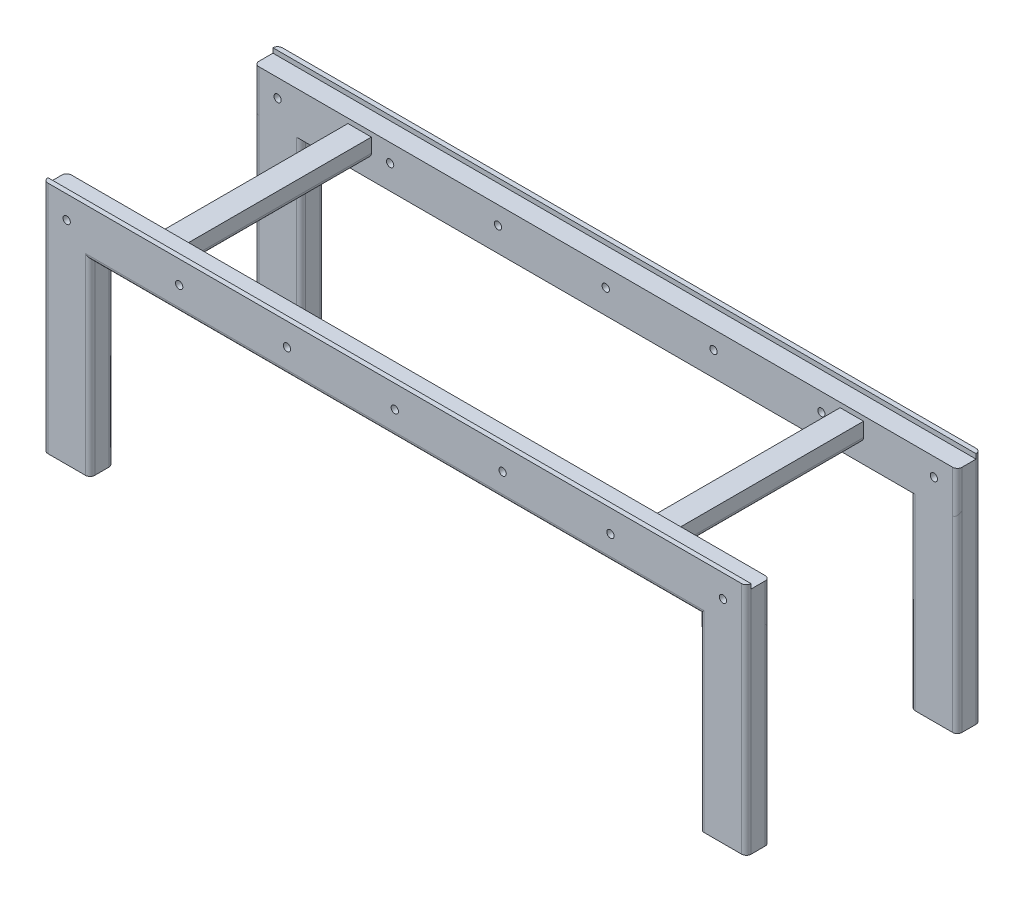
ISO-10303-21;
HEADER;
FILE_DESCRIPTION(('STEP AP214'),'2;1');
FILE_NAME('part.step','',(''),(''),'','','');
FILE_SCHEMA(('AUTOMOTIVE_DESIGN { 1 0 10303 214 1 1 1 1 }'));
ENDSEC;
DATA;
#1=APPLICATION_CONTEXT('core data for automotive mechanical design processes');
#2=APPLICATION_PROTOCOL_DEFINITION('international standard','automotive_design',2000,#1);
#3=PRODUCT_CONTEXT('',#1,'mechanical');
#4=PRODUCT('Part','Part','',(#3));
#5=PRODUCT_RELATED_PRODUCT_CATEGORY('part','',(#4));
#6=PRODUCT_DEFINITION_FORMATION('','',#4);
#7=PRODUCT_DEFINITION_CONTEXT('part definition',#1,'design');
#8=PRODUCT_DEFINITION('design','',#6,#7);
#9=PRODUCT_DEFINITION_SHAPE('','',#8);
#10=(LENGTH_UNIT() NAMED_UNIT(*) SI_UNIT(.MILLI.,.METRE.));
#11=(NAMED_UNIT(*) PLANE_ANGLE_UNIT() SI_UNIT($,.RADIAN.));
#12=(NAMED_UNIT(*) SI_UNIT($,.STERADIAN.) SOLID_ANGLE_UNIT());
#13=UNCERTAINTY_MEASURE_WITH_UNIT(LENGTH_MEASURE(1.E-05),#10,'distance_accuracy_value','');
#14=(GEOMETRIC_REPRESENTATION_CONTEXT(3) GLOBAL_UNCERTAINTY_ASSIGNED_CONTEXT((#13)) GLOBAL_UNIT_ASSIGNED_CONTEXT((#10,
#11,#12)) REPRESENTATION_CONTEXT('',''));
#15=CARTESIAN_POINT('',(0.,0.,0.));
#16=DIRECTION('',(0.,0.,1.));
#17=DIRECTION('',(1.,0.,0.));
#18=AXIS2_PLACEMENT_3D('',#15,#16,#17);
#19=CARTESIAN_POINT('',(-650.,400.,-250.));
#20=DIRECTION('',(0.,-1.,0.));
#21=DIRECTION('',(1.,0.,0.));
#22=AXIS2_PLACEMENT_3D('',#19,#20,#21);
#23=PLANE('',#22);
#24=DIRECTION('',(0.,0.,1.));
#25=VECTOR('',#24,1.);
#26=CARTESIAN_POINT('',(650.,400.,-250.));
#27=LINE('',#26,#25);
#28=CARTESIAN_POINT('',(650.,400.,-240.));
#29=VERTEX_POINT('',#28);
#30=CARTESIAN_POINT('',(650.,400.,-210.));
#31=VERTEX_POINT('',#30);
#32=EDGE_CURVE('E445',#29,#31,#27,.T.);
#33=ORIENTED_EDGE('',*,*,#32,.T.);
#34=CARTESIAN_POINT('',(660.,400.,-210.));
#35=DIRECTION('',(0.,-1.,0.));
#36=DIRECTION('',(1.,0.,0.));
#37=AXIS2_PLACEMENT_3D('',#34,#35,#36);
#38=CIRCLE('',#37,10.);
#39=CARTESIAN_POINT('',(660.,400.,-200.));
#40=VERTEX_POINT('',#39);
#41=EDGE_CURVE('E700',#31,#40,#38,.F.);
#42=ORIENTED_EDGE('',*,*,#41,.T.);
#43=DIRECTION('',(-1.,0.,0.));
#44=VECTOR('',#43,1.);
#45=CARTESIAN_POINT('',(-650.,400.,-200.));
#46=LINE('',#45,#44);
#47=CARTESIAN_POINT('',(-660.,400.,-200.));
#48=VERTEX_POINT('',#47);
#49=EDGE_CURVE('E394',#40,#48,#46,.T.);
#50=ORIENTED_EDGE('',*,*,#49,.T.);
#51=CARTESIAN_POINT('',(-660.,400.,-210.));
#52=DIRECTION('',(0.,-1.,0.));
#53=DIRECTION('',(1.,0.,0.));
#54=AXIS2_PLACEMENT_3D('',#51,#52,#53);
#55=CIRCLE('',#54,10.);
#56=CARTESIAN_POINT('',(-650.,400.,-210.));
#57=VERTEX_POINT('',#56);
#58=EDGE_CURVE('E578',#48,#57,#55,.F.);
#59=ORIENTED_EDGE('',*,*,#58,.T.);
#60=DIRECTION('',(0.,0.,1.));
#61=VECTOR('',#60,1.);
#62=CARTESIAN_POINT('',(-650.,400.,-250.));
#63=LINE('',#62,#61);
#64=CARTESIAN_POINT('',(-650.,400.,-240.));
#65=VERTEX_POINT('',#64);
#66=EDGE_CURVE('E441',#65,#57,#63,.T.);
#67=ORIENTED_EDGE('',*,*,#66,.F.);
#68=DIRECTION('',(1.,0.,0.));
#69=VECTOR('',#68,1.);
#70=CARTESIAN_POINT('',(-650.,400.,-240.));
#71=LINE('',#70,#69);
#72=EDGE_CURVE('E564',#65,#29,#71,.T.);
#73=ORIENTED_EDGE('',*,*,#72,.T.);
#74=EDGE_LOOP('',(#33,#42,#50,#59,#67,#73));
#75=FACE_BOUND('',#74,.T.);
#76=ADVANCED_FACE('F40',(#75),#23,.T.);
#77=CARTESIAN_POINT('',(750.,490.,240.000000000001));
#78=DIRECTION('',(0.,1.,0.));
#79=DIRECTION('',(0.,0.,1.));
#80=AXIS2_PLACEMENT_3D('',#77,#78,#79);
#81=PLANE('',#80);
#82=DIRECTION('',(0.,0.,-1.));
#83=VECTOR('',#82,1.);
#84=CARTESIAN_POINT('',(750.,490.,240.000000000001));
#85=LINE('',#84,#83);
#86=CARTESIAN_POINT('',(750.,490.,240.000000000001));
#87=VERTEX_POINT('',#86);
#88=CARTESIAN_POINT('',(750.,490.,210.));
#89=VERTEX_POINT('',#88);
#90=EDGE_CURVE('E421',#87,#89,#85,.T.);
#91=ORIENTED_EDGE('',*,*,#90,.T.);
#92=CARTESIAN_POINT('',(740.,490.,210.));
#93=DIRECTION('',(0.,1.,0.));
#94=DIRECTION('',(0.,0.,1.));
#95=AXIS2_PLACEMENT_3D('',#92,#93,#94);
#96=CIRCLE('',#95,10.);
#97=CARTESIAN_POINT('',(740.,490.,200.));
#98=VERTEX_POINT('',#97);
#99=EDGE_CURVE('E686',#89,#98,#96,.T.);
#100=ORIENTED_EDGE('',*,*,#99,.T.);
#101=DIRECTION('',(1.,0.,0.));
#102=VECTOR('',#101,1.);
#103=CARTESIAN_POINT('',(750.,490.,200.));
#104=LINE('',#103,#102);
#105=CARTESIAN_POINT('',(-740.,490.,200.));
#106=VERTEX_POINT('',#105);
#107=EDGE_CURVE('E396',#106,#98,#104,.T.);
#108=ORIENTED_EDGE('',*,*,#107,.F.);
#109=CARTESIAN_POINT('',(-740.,490.,210.));
#110=DIRECTION('',(0.,1.,0.));
#111=DIRECTION('',(0.,0.,1.));
#112=AXIS2_PLACEMENT_3D('',#109,#110,#111);
#113=CIRCLE('',#112,10.);
#114=CARTESIAN_POINT('',(-750.,490.,210.));
#115=VERTEX_POINT('',#114);
#116=EDGE_CURVE('E684',#106,#115,#113,.T.);
#117=ORIENTED_EDGE('',*,*,#116,.T.);
#118=DIRECTION('',(0.,0.,-1.));
#119=VECTOR('',#118,1.);
#120=CARTESIAN_POINT('',(-750.,490.,240.000000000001));
#121=LINE('',#120,#119);
#122=CARTESIAN_POINT('',(-750.,490.,240.000000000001));
#123=VERTEX_POINT('',#122);
#124=EDGE_CURVE('E412',#123,#115,#121,.T.);
#125=ORIENTED_EDGE('',*,*,#124,.F.);
#126=DIRECTION('',(-1.,0.,0.));
#127=VECTOR('',#126,1.);
#128=CARTESIAN_POINT('',(750.,490.,240.000000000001));
#129=LINE('',#128,#127);
#130=EDGE_CURVE('E427',#87,#123,#129,.T.);
#131=ORIENTED_EDGE('',*,*,#130,.F.);
#132=EDGE_LOOP('',(#91,#100,#108,#117,#125,#131));
#133=FACE_BOUND('',#132,.T.);
#134=ADVANCED_FACE('F852',(#133),#81,.T.);
#135=CARTESIAN_POINT('',(-750.,500.,-250.));
#136=DIRECTION('',(0.,0.,-1.));
#137=DIRECTION('',(-1.,0.,0.));
#138=AXIS2_PLACEMENT_3D('',#135,#136,#137);
#139=PLANE('',#138);
#140=CARTESIAN_POINT('',(0.,451.636343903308,-250.));
#141=DIRECTION('',(0.,0.,1.));
#142=DIRECTION('',(1.,0.,0.));
#143=AXIS2_PLACEMENT_3D('',#140,#141,#142);
#144=CIRCLE('',#143,7.74999999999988);
#145=CARTESIAN_POINT('',(7.74999999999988,451.636343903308,-250.));
#146=VERTEX_POINT('',#145);
#147=EDGE_CURVE('E650',#146,#146,#144,.T.);
#148=ORIENTED_EDGE('',*,*,#147,.T.);
#149=EDGE_LOOP('',(#148));
#150=FACE_BOUND('',#149,.T.);
#151=DIRECTION('',(1.,0.,0.));
#152=VECTOR('',#151,1.);
#153=CARTESIAN_POINT('',(-750.,410.,-250.));
#154=LINE('',#153,#152);
#155=CARTESIAN_POINT('',(660.,410.,-250.));
#156=VERTEX_POINT('',#155);
#157=CARTESIAN_POINT('',(-660.,410.,-250.));
#158=VERTEX_POINT('',#157);
#159=EDGE_CURVE('E485',#156,#158,#154,.F.);
#160=ORIENTED_EDGE('',*,*,#159,.T.);
#161=DIRECTION('',(0.,-1.,0.));
#162=VECTOR('',#161,1.);
#163=CARTESIAN_POINT('',(-660.,0.,-250.));
#164=LINE('',#163,#162);
#165=CARTESIAN_POINT('',(-660.,0.,-250.));
#166=VERTEX_POINT('',#165);
#167=EDGE_CURVE('E489',#158,#166,#164,.T.);
#168=ORIENTED_EDGE('',*,*,#167,.T.);
#169=DIRECTION('',(1.,0.,0.));
#170=VECTOR('',#169,1.);
#171=CARTESIAN_POINT('',(-750.,0.,-250.));
#172=LINE('',#171,#170);
#173=CARTESIAN_POINT('',(-740.,0.,-250.));
#174=VERTEX_POINT('',#173);
#175=EDGE_CURVE('E471',#174,#166,#172,.T.);
#176=ORIENTED_EDGE('',*,*,#175,.F.);
#177=DIRECTION('',(0.,-1.,0.));
#178=VECTOR('',#177,1.);
#179=CARTESIAN_POINT('',(-740.,500.,-250.));
#180=LINE('',#179,#178);
#181=CARTESIAN_POINT('',(-740.,500.,-250.));
#182=VERTEX_POINT('',#181);
#183=EDGE_CURVE('E480',#174,#182,#180,.F.);
#184=ORIENTED_EDGE('',*,*,#183,.T.);
#185=DIRECTION('',(1.,0.,0.));
#186=VECTOR('',#185,1.);
#187=CARTESIAN_POINT('',(-750.,500.,-250.));
#188=LINE('',#187,#186);
#189=CARTESIAN_POINT('',(740.,500.,-250.));
#190=VERTEX_POINT('',#189);
#191=EDGE_CURVE('E455',#182,#190,#188,.T.);
#192=ORIENTED_EDGE('',*,*,#191,.T.);
#193=DIRECTION('',(0.,-1.,0.));
#194=VECTOR('',#193,1.);
#195=CARTESIAN_POINT('',(740.,500.,-250.));
#196=LINE('',#195,#194);
#197=CARTESIAN_POINT('',(740.,0.,-250.));
#198=VERTEX_POINT('',#197);
#199=EDGE_CURVE('E482',#190,#198,#196,.T.);
#200=ORIENTED_EDGE('',*,*,#199,.T.);
#201=CARTESIAN_POINT('',(660.,0.,-250.));
#202=VERTEX_POINT('',#201);
#203=EDGE_CURVE('E468',#202,#198,#172,.T.);
#204=ORIENTED_EDGE('',*,*,#203,.F.);
#205=DIRECTION('',(0.,-1.,0.));
#206=VECTOR('',#205,1.);
#207=CARTESIAN_POINT('',(660.,499.999999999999,-250.));
#208=LINE('',#207,#206);
#209=EDGE_CURVE('E487',#202,#156,#208,.F.);
#210=ORIENTED_EDGE('',*,*,#209,.T.);
#211=EDGE_LOOP('',(#160,#168,#176,#184,#192,#200,#204,#210));
#212=FACE_BOUND('',#211,.T.);
#213=CARTESIAN_POINT('',(700.,451.636343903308,-250.));
#214=DIRECTION('',(0.,0.,1.));
#215=DIRECTION('',(1.,0.,0.));
#216=AXIS2_PLACEMENT_3D('',#213,#214,#215);
#217=CIRCLE('',#216,7.74999999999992);
#218=CARTESIAN_POINT('',(707.75,451.636343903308,-250.));
#219=VERTEX_POINT('',#218);
#220=EDGE_CURVE('E635',#219,#219,#217,.T.);
#221=ORIENTED_EDGE('',*,*,#220,.T.);
#222=EDGE_LOOP('',(#221));
#223=FACE_BOUND('',#222,.T.);
#224=CARTESIAN_POINT('',(460.,451.636343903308,-250.));
#225=DIRECTION('',(0.,0.,1.));
#226=DIRECTION('',(1.,0.,0.));
#227=AXIS2_PLACEMENT_3D('',#224,#225,#226);
#228=CIRCLE('',#227,7.74999999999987);
#229=CARTESIAN_POINT('',(467.75,451.636343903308,-250.));
#230=VERTEX_POINT('',#229);
#231=EDGE_CURVE('E640',#230,#230,#228,.T.);
#232=ORIENTED_EDGE('',*,*,#231,.T.);
#233=EDGE_LOOP('',(#232));
#234=FACE_BOUND('',#233,.T.);
#235=CARTESIAN_POINT('',(230.,451.636343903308,-250.));
#236=DIRECTION('',(0.,0.,1.));
#237=DIRECTION('',(1.,0.,0.));
#238=AXIS2_PLACEMENT_3D('',#235,#236,#237);
#239=CIRCLE('',#238,7.74999999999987);
#240=CARTESIAN_POINT('',(237.75,451.636343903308,-250.));
#241=VERTEX_POINT('',#240);
#242=EDGE_CURVE('E645',#241,#241,#239,.T.);
#243=ORIENTED_EDGE('',*,*,#242,.T.);
#244=EDGE_LOOP('',(#243));
#245=FACE_BOUND('',#244,.T.);
#246=CARTESIAN_POINT('',(-230.,451.636343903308,-250.));
#247=DIRECTION('',(0.,0.,1.));
#248=DIRECTION('',(1.,0.,0.));
#249=AXIS2_PLACEMENT_3D('',#246,#247,#248);
#250=CIRCLE('',#249,7.74999999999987);
#251=CARTESIAN_POINT('',(-222.25,451.636343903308,-250.));
#252=VERTEX_POINT('',#251);
#253=EDGE_CURVE('E655',#252,#252,#250,.T.);
#254=ORIENTED_EDGE('',*,*,#253,.T.);
#255=EDGE_LOOP('',(#254));
#256=FACE_BOUND('',#255,.T.);
#257=CARTESIAN_POINT('',(-460.,451.636343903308,-250.));
#258=DIRECTION('',(0.,0.,1.));
#259=DIRECTION('',(1.,0.,0.));
#260=AXIS2_PLACEMENT_3D('',#257,#258,#259);
#261=CIRCLE('',#260,7.74999999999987);
#262=CARTESIAN_POINT('',(-452.25,451.636343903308,-250.));
#263=VERTEX_POINT('',#262);
#264=EDGE_CURVE('E660',#263,#263,#261,.T.);
#265=ORIENTED_EDGE('',*,*,#264,.T.);
#266=EDGE_LOOP('',(#265));
#267=FACE_BOUND('',#266,.T.);
#268=CARTESIAN_POINT('',(-700.,451.636343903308,-250.));
#269=DIRECTION('',(0.,0.,1.));
#270=DIRECTION('',(1.,0.,0.));
#271=AXIS2_PLACEMENT_3D('',#268,#269,#270);
#272=CIRCLE('',#271,7.74999999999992);
#273=CARTESIAN_POINT('',(-692.25,451.636343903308,-250.));
#274=VERTEX_POINT('',#273);
#275=EDGE_CURVE('E665',#274,#274,#272,.T.);
#276=ORIENTED_EDGE('',*,*,#275,.T.);
#277=EDGE_LOOP('',(#276));
#278=FACE_BOUND('',#277,.T.);
#279=ADVANCED_FACE('F859',(#150,#212,#223,#234,#245,#256,#267,#278),#139,.T.);
#280=CARTESIAN_POINT('',(-750.,500.,250.));
#281=DIRECTION('',(0.,0.,-1.));
#282=DIRECTION('',(-1.,0.,0.));
#283=AXIS2_PLACEMENT_3D('',#280,#281,#282);
#284=PLANE('',#283);
#285=CARTESIAN_POINT('',(-700.,451.636343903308,250.));
#286=DIRECTION('',(0.,0.,1.));
#287=DIRECTION('',(1.,0.,0.));
#288=AXIS2_PLACEMENT_3D('',#285,#286,#287);
#289=CIRCLE('',#288,7.74999999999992);
#290=CARTESIAN_POINT('',(-692.25,451.636343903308,250.));
#291=VERTEX_POINT('',#290);
#292=EDGE_CURVE('E378',#291,#291,#289,.T.);
#293=ORIENTED_EDGE('',*,*,#292,.F.);
#294=EDGE_LOOP('',(#293));
#295=FACE_BOUND('',#294,.T.);
#296=CARTESIAN_POINT('',(0.,451.636343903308,250.));
#297=DIRECTION('',(0.,0.,1.));
#298=DIRECTION('',(1.,0.,0.));
#299=AXIS2_PLACEMENT_3D('',#296,#297,#298);
#300=CIRCLE('',#299,7.74999999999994);
#301=CARTESIAN_POINT('',(7.74999999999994,451.636343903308,250.));
#302=VERTEX_POINT('',#301);
#303=EDGE_CURVE('E792',#302,#302,#300,.T.);
#304=ORIENTED_EDGE('',*,*,#303,.F.);
#305=EDGE_LOOP('',(#304));
#306=FACE_BOUND('',#305,.T.);
#307=CARTESIAN_POINT('',(230.,451.636343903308,250.));
#308=DIRECTION('',(0.,0.,1.));
#309=DIRECTION('',(1.,0.,0.));
#310=AXIS2_PLACEMENT_3D('',#307,#308,#309);
#311=CIRCLE('',#310,7.74999999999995);
#312=CARTESIAN_POINT('',(237.75,451.636343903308,250.));
#313=VERTEX_POINT('',#312);
#314=EDGE_CURVE('E785',#313,#313,#311,.T.);
#315=ORIENTED_EDGE('',*,*,#314,.F.);
#316=EDGE_LOOP('',(#315));
#317=FACE_BOUND('',#316,.T.);
#318=CARTESIAN_POINT('',(460.,451.636343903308,250.));
#319=DIRECTION('',(0.,0.,1.));
#320=DIRECTION('',(1.,0.,0.));
#321=AXIS2_PLACEMENT_3D('',#318,#319,#320);
#322=CIRCLE('',#321,7.74999999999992);
#323=CARTESIAN_POINT('',(467.75,451.636343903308,250.));
#324=VERTEX_POINT('',#323);
#325=EDGE_CURVE('E778',#324,#324,#322,.T.);
#326=ORIENTED_EDGE('',*,*,#325,.F.);
#327=EDGE_LOOP('',(#326));
#328=FACE_BOUND('',#327,.T.);
#329=CARTESIAN_POINT('',(700.,451.636343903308,250.));
#330=DIRECTION('',(0.,0.,1.));
#331=DIRECTION('',(1.,0.,0.));
#332=AXIS2_PLACEMENT_3D('',#329,#330,#331);
#333=CIRCLE('',#332,7.74999999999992);
#334=CARTESIAN_POINT('',(707.75,451.636343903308,250.));
#335=VERTEX_POINT('',#334);
#336=EDGE_CURVE('E771',#335,#335,#333,.T.);
#337=ORIENTED_EDGE('',*,*,#336,.F.);
#338=EDGE_LOOP('',(#337));
#339=FACE_BOUND('',#338,.T.);
#340=DIRECTION('',(1.,0.,0.));
#341=VECTOR('',#340,1.);
#342=CARTESIAN_POINT('',(650.,410.,250.));
#343=LINE('',#342,#341);
#344=CARTESIAN_POINT('',(-660.,410.,250.));
#345=VERTEX_POINT('',#344);
#346=CARTESIAN_POINT('',(660.,410.,250.));
#347=VERTEX_POINT('',#346);
#348=EDGE_CURVE('E612',#345,#347,#343,.T.);
#349=ORIENTED_EDGE('',*,*,#348,.T.);
#350=DIRECTION('',(0.,-1.,0.));
#351=VECTOR('',#350,1.);
#352=CARTESIAN_POINT('',(660.,0.,250.));
#353=LINE('',#352,#351);
#354=CARTESIAN_POINT('',(660.,0.,250.));
#355=VERTEX_POINT('',#354);
#356=EDGE_CURVE('E614',#347,#355,#353,.T.);
#357=ORIENTED_EDGE('',*,*,#356,.T.);
#358=DIRECTION('',(1.,0.,0.));
#359=VECTOR('',#358,1.);
#360=CARTESIAN_POINT('',(-750.,0.,250.));
#361=LINE('',#360,#359);
#362=CARTESIAN_POINT('',(740.,0.,250.));
#363=VERTEX_POINT('',#362);
#364=EDGE_CURVE('E464',#355,#363,#361,.T.);
#365=ORIENTED_EDGE('',*,*,#364,.T.);
#366=DIRECTION('',(0.,-1.,0.));
#367=VECTOR('',#366,1.);
#368=CARTESIAN_POINT('',(740.,500.,250.));
#369=LINE('',#368,#367);
#370=CARTESIAN_POINT('',(740.,500.,250.));
#371=VERTEX_POINT('',#370);
#372=EDGE_CURVE('E522',#363,#371,#369,.F.);
#373=ORIENTED_EDGE('',*,*,#372,.T.);
#374=DIRECTION('',(1.,0.,0.));
#375=VECTOR('',#374,1.);
#376=CARTESIAN_POINT('',(-750.,500.,250.));
#377=LINE('',#376,#375);
#378=CARTESIAN_POINT('',(-740.,500.,250.));
#379=VERTEX_POINT('',#378);
#380=EDGE_CURVE('E452',#379,#371,#377,.T.);
#381=ORIENTED_EDGE('',*,*,#380,.F.);
#382=DIRECTION('',(0.,-1.,0.));
#383=VECTOR('',#382,1.);
#384=CARTESIAN_POINT('',(-740.,500.,250.));
#385=LINE('',#384,#383);
#386=CARTESIAN_POINT('',(-740.,0.,250.));
#387=VERTEX_POINT('',#386);
#388=EDGE_CURVE('E519',#379,#387,#385,.T.);
#389=ORIENTED_EDGE('',*,*,#388,.T.);
#390=CARTESIAN_POINT('',(-660.,0.,250.));
#391=VERTEX_POINT('',#390);
#392=EDGE_CURVE('E460',#387,#391,#361,.T.);
#393=ORIENTED_EDGE('',*,*,#392,.T.);
#394=DIRECTION('',(0.,-1.,0.));
#395=VECTOR('',#394,1.);
#396=CARTESIAN_POINT('',(-660.,500.,250.));
#397=LINE('',#396,#395);
#398=EDGE_CURVE('E524',#391,#345,#397,.F.);
#399=ORIENTED_EDGE('',*,*,#398,.T.);
#400=EDGE_LOOP('',(#349,#357,#365,#373,#381,#389,#393,#399));
#401=FACE_BOUND('',#400,.T.);
#402=CARTESIAN_POINT('',(-230.,451.636343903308,250.));
#403=DIRECTION('',(0.,0.,1.));
#404=DIRECTION('',(1.,0.,0.));
#405=AXIS2_PLACEMENT_3D('',#402,#403,#404);
#406=CIRCLE('',#405,7.74999999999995);
#407=CARTESIAN_POINT('',(-222.25,451.636343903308,250.));
#408=VERTEX_POINT('',#407);
#409=EDGE_CURVE('E799',#408,#408,#406,.T.);
#410=ORIENTED_EDGE('',*,*,#409,.F.);
#411=EDGE_LOOP('',(#410));
#412=FACE_BOUND('',#411,.T.);
#413=CARTESIAN_POINT('',(-460.,451.636343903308,250.));
#414=DIRECTION('',(0.,0.,1.));
#415=DIRECTION('',(1.,0.,0.));
#416=AXIS2_PLACEMENT_3D('',#413,#414,#415);
#417=CIRCLE('',#416,7.74999999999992);
#418=CARTESIAN_POINT('',(-452.25,451.636343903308,250.));
#419=VERTEX_POINT('',#418);
#420=EDGE_CURVE('E806',#419,#419,#417,.T.);
#421=ORIENTED_EDGE('',*,*,#420,.F.);
#422=EDGE_LOOP('',(#421));
#423=FACE_BOUND('',#422,.T.);
#424=ADVANCED_FACE('F866',(#295,#306,#317,#328,#339,#401,#412,#423),#284,.F.);
#425=DIRECTION('',(-1.,0.,0.));
#426=VECTOR('',#425,1.);
#427=CARTESIAN_POINT('',(-650.,400.,200.));
#428=LINE('',#427,#426);
#429=CARTESIAN_POINT('',(660.,400.,200.));
#430=VERTEX_POINT('',#429);
#431=CARTESIAN_POINT('',(-660.,400.,200.));
#432=VERTEX_POINT('',#431);
#433=EDGE_CURVE('E399',#430,#432,#428,.T.);
#434=ORIENTED_EDGE('',*,*,#433,.F.);
#435=CARTESIAN_POINT('',(660.,400.,210.));
#436=DIRECTION('',(0.,-1.,0.));
#437=DIRECTION('',(1.,0.,0.));
#438=AXIS2_PLACEMENT_3D('',#435,#436,#437);
#439=CIRCLE('',#438,10.);
#440=CARTESIAN_POINT('',(650.,400.,210.));
#441=VERTEX_POINT('',#440);
#442=EDGE_CURVE('E583',#430,#441,#439,.F.);
#443=ORIENTED_EDGE('',*,*,#442,.T.);
#444=CARTESIAN_POINT('',(650.,400.,240.));
#445=VERTEX_POINT('',#444);
#446=EDGE_CURVE('E448',#441,#445,#27,.T.);
#447=ORIENTED_EDGE('',*,*,#446,.T.);
#448=DIRECTION('',(1.,0.,0.));
#449=VECTOR('',#448,1.);
#450=CARTESIAN_POINT('',(-660.,400.,240.));
#451=LINE('',#450,#449);
#452=CARTESIAN_POINT('',(-650.,400.,240.));
#453=VERTEX_POINT('',#452);
#454=EDGE_CURVE('E621',#445,#453,#451,.F.);
#455=ORIENTED_EDGE('',*,*,#454,.T.);
#456=CARTESIAN_POINT('',(-650.,400.,210.));
#457=VERTEX_POINT('',#456);
#458=EDGE_CURVE('E442',#457,#453,#63,.T.);
#459=ORIENTED_EDGE('',*,*,#458,.F.);
#460=CARTESIAN_POINT('',(-660.,400.,210.));
#461=DIRECTION('',(0.,-1.,0.));
#462=DIRECTION('',(1.,0.,0.));
#463=AXIS2_PLACEMENT_3D('',#460,#461,#462);
#464=CIRCLE('',#463,10.);
#465=EDGE_CURVE('E580',#457,#432,#464,.F.);
#466=ORIENTED_EDGE('',*,*,#465,.T.);
#467=EDGE_LOOP('',(#434,#443,#447,#455,#459,#466));
#468=FACE_BOUND('',#467,.T.);
#469=ADVANCED_FACE('F855',(#468),#23,.T.);
#470=DIRECTION('',(1.,0.,0.));
#471=VECTOR('',#470,1.);
#472=CARTESIAN_POINT('',(750.,490.,-200.));
#473=LINE('',#472,#471);
#474=CARTESIAN_POINT('',(-740.000000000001,490.,-200.));
#475=VERTEX_POINT('',#474);
#476=CARTESIAN_POINT('',(740.,490.,-200.));
#477=VERTEX_POINT('',#476);
#478=EDGE_CURVE('E388',#475,#477,#473,.T.);
#479=ORIENTED_EDGE('',*,*,#478,.T.);
#480=CARTESIAN_POINT('',(740.,490.,-210.));
#481=DIRECTION('',(0.,1.,0.));
#482=DIRECTION('',(0.,0.,1.));
#483=AXIS2_PLACEMENT_3D('',#480,#481,#482);
#484=CIRCLE('',#483,10.);
#485=CARTESIAN_POINT('',(750.,490.,-210.));
#486=VERTEX_POINT('',#485);
#487=EDGE_CURVE('E675',#477,#486,#484,.T.);
#488=ORIENTED_EDGE('',*,*,#487,.T.);
#489=CARTESIAN_POINT('',(750.,490.,-239.999999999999));
#490=VERTEX_POINT('',#489);
#491=EDGE_CURVE('E420',#486,#490,#85,.T.);
#492=ORIENTED_EDGE('',*,*,#491,.T.);
#493=DIRECTION('',(-1.,0.,0.));
#494=VECTOR('',#493,1.);
#495=CARTESIAN_POINT('',(750.,490.,-239.999999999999));
#496=LINE('',#495,#494);
#497=CARTESIAN_POINT('',(-750.,490.,-239.999999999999));
#498=VERTEX_POINT('',#497);
#499=EDGE_CURVE('E424',#490,#498,#496,.T.);
#500=ORIENTED_EDGE('',*,*,#499,.T.);
#501=CARTESIAN_POINT('',(-750.,490.,-210.));
#502=VERTEX_POINT('',#501);
#503=EDGE_CURVE('E411',#502,#498,#121,.T.);
#504=ORIENTED_EDGE('',*,*,#503,.F.);
#505=CARTESIAN_POINT('',(-740.,490.,-210.));
#506=DIRECTION('',(0.,1.,0.));
#507=DIRECTION('',(0.,0.,1.));
#508=AXIS2_PLACEMENT_3D('',#505,#506,#507);
#509=CIRCLE('',#508,10.);
#510=EDGE_CURVE('E673',#502,#475,#509,.T.);
#511=ORIENTED_EDGE('',*,*,#510,.T.);
#512=EDGE_LOOP('',(#479,#488,#492,#500,#504,#511));
#513=FACE_BOUND('',#512,.T.);
#514=ADVANCED_FACE('F862',(#513),#81,.T.);
#515=CARTESIAN_POINT('',(750.,500.,-250.));
#516=DIRECTION('',(1.,0.,0.));
#517=DIRECTION('',(0.,0.,-1.));
#518=AXIS2_PLACEMENT_3D('',#515,#516,#517);
#519=PLANE('',#518);
#520=DIRECTION('',(0.,-1.,0.));
#521=VECTOR('',#520,1.);
#522=CARTESIAN_POINT('',(750.,400.,210.));
#523=LINE('',#522,#521);
#524=CARTESIAN_POINT('',(750.,0.,210.));
#525=VERTEX_POINT('',#524);
#526=CARTESIAN_POINT('',(750.,410.,210.));
#527=VERTEX_POINT('',#526);
#528=EDGE_CURVE('E549',#525,#527,#523,.F.);
#529=ORIENTED_EDGE('',*,*,#528,.T.);
#530=DIRECTION('',(0.,-1.,0.));
#531=VECTOR('',#530,1.);
#532=CARTESIAN_POINT('',(750.,490.,210.));
#533=LINE('',#532,#531);
#534=EDGE_CURVE('E682',#527,#89,#533,.F.);
#535=ORIENTED_EDGE('',*,*,#534,.T.);
#536=ORIENTED_EDGE('',*,*,#90,.F.);
#537=DIRECTION('',(0.,-1.,0.));
#538=VECTOR('',#537,1.);
#539=CARTESIAN_POINT('',(750.,0.,240.));
#540=LINE('',#539,#538);
#541=CARTESIAN_POINT('',(750.,0.,240.));
#542=VERTEX_POINT('',#541);
#543=EDGE_CURVE('E542',#87,#542,#540,.T.);
#544=ORIENTED_EDGE('',*,*,#543,.T.);
#545=DIRECTION('',(0.,0.,1.));
#546=VECTOR('',#545,1.);
#547=CARTESIAN_POINT('',(750.,0.,-250.));
#548=LINE('',#547,#546);
#549=EDGE_CURVE('E463',#525,#542,#548,.T.);
#550=ORIENTED_EDGE('',*,*,#549,.F.);
#551=EDGE_LOOP('',(#529,#535,#536,#544,#550));
#552=FACE_BOUND('',#551,.T.);
#553=ADVANCED_FACE('F872',(#552),#519,.T.);
#554=CARTESIAN_POINT('',(-750.,500.,-250.));
#555=DIRECTION('',(1.,0.,0.));
#556=DIRECTION('',(0.,0.,-1.));
#557=AXIS2_PLACEMENT_3D('',#554,#555,#556);
#558=PLANE('',#557);
#559=DIRECTION('',(0.,-1.,0.));
#560=VECTOR('',#559,1.);
#561=CARTESIAN_POINT('',(-750.,410.,-210.));
#562=LINE('',#561,#560);
#563=CARTESIAN_POINT('',(-750.,0.,-210.));
#564=VERTEX_POINT('',#563);
#565=CARTESIAN_POINT('',(-750.,410.,-210.));
#566=VERTEX_POINT('',#565);
#567=EDGE_CURVE('E585',#564,#566,#562,.F.);
#568=ORIENTED_EDGE('',*,*,#567,.T.);
#569=DIRECTION('',(0.,-1.,0.));
#570=VECTOR('',#569,1.);
#571=CARTESIAN_POINT('',(-750.,490.,-210.));
#572=LINE('',#571,#570);
#573=EDGE_CURVE('E691',#566,#502,#572,.F.);
#574=ORIENTED_EDGE('',*,*,#573,.T.);
#575=ORIENTED_EDGE('',*,*,#503,.T.);
#576=DIRECTION('',(0.,-1.,0.));
#577=VECTOR('',#576,1.);
#578=CARTESIAN_POINT('',(-750.,0.,-240.));
#579=LINE('',#578,#577);
#580=CARTESIAN_POINT('',(-750.,0.,-240.));
#581=VERTEX_POINT('',#580);
#582=EDGE_CURVE('E572',#498,#581,#579,.T.);
#583=ORIENTED_EDGE('',*,*,#582,.T.);
#584=DIRECTION('',(0.,0.,1.));
#585=VECTOR('',#584,1.);
#586=CARTESIAN_POINT('',(-750.,0.,-250.));
#587=LINE('',#586,#585);
#588=EDGE_CURVE('E456',#581,#564,#587,.T.);
#589=ORIENTED_EDGE('',*,*,#588,.T.);
#590=EDGE_LOOP('',(#568,#574,#575,#583,#589));
#591=FACE_BOUND('',#590,.T.);
#592=ADVANCED_FACE('F1411',(#591),#558,.F.);
#593=ORIENTED_EDGE('',*,*,#491,.F.);
#594=DIRECTION('',(0.,-1.,0.));
#595=VECTOR('',#594,1.);
#596=CARTESIAN_POINT('',(750.,500.,-210.));
#597=LINE('',#596,#595);
#598=CARTESIAN_POINT('',(750.,410.,-210.));
#599=VERTEX_POINT('',#598);
#600=EDGE_CURVE('E626',#486,#599,#597,.T.);
#601=ORIENTED_EDGE('',*,*,#600,.T.);
#602=DIRECTION('',(0.,-1.,0.));
#603=VECTOR('',#602,1.);
#604=CARTESIAN_POINT('',(750.,500.,-210.));
#605=LINE('',#604,#603);
#606=CARTESIAN_POINT('',(750.,0.,-210.));
#607=VERTEX_POINT('',#606);
#608=EDGE_CURVE('E547',#599,#607,#605,.T.);
#609=ORIENTED_EDGE('',*,*,#608,.T.);
#610=CARTESIAN_POINT('',(750.,0.,-240.));
#611=VERTEX_POINT('',#610);
#612=EDGE_CURVE('E465',#611,#607,#548,.T.);
#613=ORIENTED_EDGE('',*,*,#612,.F.);
#614=DIRECTION('',(0.,-1.,0.));
#615=VECTOR('',#614,1.);
#616=CARTESIAN_POINT('',(750.,500.,-240.));
#617=LINE('',#616,#615);
#618=EDGE_CURVE('E544',#611,#490,#617,.F.);
#619=ORIENTED_EDGE('',*,*,#618,.T.);
#620=EDGE_LOOP('',(#593,#601,#609,#613,#619));
#621=FACE_BOUND('',#620,.T.);
#622=ADVANCED_FACE('F1409',(#621),#519,.T.);
#623=ORIENTED_EDGE('',*,*,#124,.T.);
#624=DIRECTION('',(0.,-1.,0.));
#625=VECTOR('',#624,1.);
#626=CARTESIAN_POINT('',(-750.,500.,210.));
#627=LINE('',#626,#625);
#628=CARTESIAN_POINT('',(-750.,410.,210.));
#629=VERTEX_POINT('',#628);
#630=EDGE_CURVE('E688',#115,#629,#627,.T.);
#631=ORIENTED_EDGE('',*,*,#630,.T.);
#632=DIRECTION('',(0.,-1.,0.));
#633=VECTOR('',#632,1.);
#634=CARTESIAN_POINT('',(-750.,500.,210.));
#635=LINE('',#634,#633);
#636=CARTESIAN_POINT('',(-750.,0.,210.));
#637=VERTEX_POINT('',#636);
#638=EDGE_CURVE('E596',#629,#637,#635,.T.);
#639=ORIENTED_EDGE('',*,*,#638,.T.);
#640=CARTESIAN_POINT('',(-750.,0.,240.));
#641=VERTEX_POINT('',#640);
#642=EDGE_CURVE('E474',#637,#641,#587,.T.);
#643=ORIENTED_EDGE('',*,*,#642,.T.);
#644=DIRECTION('',(0.,-1.,0.));
#645=VECTOR('',#644,1.);
#646=CARTESIAN_POINT('',(-750.,500.,240.));
#647=LINE('',#646,#645);
#648=EDGE_CURVE('E570',#641,#123,#647,.F.);
#649=ORIENTED_EDGE('',*,*,#648,.T.);
#650=EDGE_LOOP('',(#623,#631,#639,#643,#649));
#651=FACE_BOUND('',#650,.T.);
#652=ADVANCED_FACE('F1010',(#651),#558,.F.);
#653=CARTESIAN_POINT('',(0.,500.,0.));
#654=DIRECTION('',(0.,-1.,0.));
#655=DIRECTION('',(0.,0.,-1.));
#656=AXIS2_PLACEMENT_3D('',#653,#654,#655);
#657=PLANE('',#656);
#658=DIRECTION('',(-1.,0.,0.));
#659=VECTOR('',#658,1.);
#660=CARTESIAN_POINT('',(0.,500.,-239.999999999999));
#661=LINE('',#660,#659);
#662=CARTESIAN_POINT('',(750.,500.,-239.999999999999));
#663=VERTEX_POINT('',#662);
#664=CARTESIAN_POINT('',(-750.,500.,-239.999999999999));
#665=VERTEX_POINT('',#664);
#666=EDGE_CURVE('E477',#663,#665,#661,.T.);
#667=ORIENTED_EDGE('',*,*,#666,.F.);
#668=CARTESIAN_POINT('',(740.,500.,-240.));
#669=DIRECTION('',(0.,-1.,0.));
#670=DIRECTION('',(0.,0.,-1.));
#671=AXIS2_PLACEMENT_3D('',#668,#669,#670);
#672=CIRCLE('',#671,10.);
#673=EDGE_CURVE('E568',#663,#190,#672,.F.);
#674=ORIENTED_EDGE('',*,*,#673,.T.);
#675=ORIENTED_EDGE('',*,*,#191,.F.);
#676=CARTESIAN_POINT('',(-740.,500.,-240.));
#677=DIRECTION('',(0.,-1.,0.));
#678=DIRECTION('',(0.,0.,-1.));
#679=AXIS2_PLACEMENT_3D('',#676,#677,#678);
#680=CIRCLE('',#679,10.);
#681=EDGE_CURVE('E566',#182,#665,#680,.F.);
#682=ORIENTED_EDGE('',*,*,#681,.T.);
#683=EDGE_LOOP('',(#667,#674,#675,#682));
#684=FACE_BOUND('',#683,.T.);
#685=ADVANCED_FACE('F950',(#684),#657,.F.);
#686=ORIENTED_EDGE('',*,*,#380,.T.);
#687=CARTESIAN_POINT('',(740.,500.,240.));
#688=DIRECTION('',(0.,-1.,0.));
#689=DIRECTION('',(0.,0.,-1.));
#690=AXIS2_PLACEMENT_3D('',#687,#688,#689);
#691=CIRCLE('',#690,10.);
#692=CARTESIAN_POINT('',(750.,500.,240.000000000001));
#693=VERTEX_POINT('',#692);
#694=EDGE_CURVE('E576',#371,#693,#691,.F.);
#695=ORIENTED_EDGE('',*,*,#694,.T.);
#696=DIRECTION('',(1.,0.,0.));
#697=VECTOR('',#696,1.);
#698=CARTESIAN_POINT('',(0.,500.,240.000000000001));
#699=LINE('',#698,#697);
#700=CARTESIAN_POINT('',(-750.,500.,240.000000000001));
#701=VERTEX_POINT('',#700);
#702=EDGE_CURVE('E459',#701,#693,#699,.T.);
#703=ORIENTED_EDGE('',*,*,#702,.F.);
#704=CARTESIAN_POINT('',(-740.,500.,240.));
#705=DIRECTION('',(0.,-1.,0.));
#706=DIRECTION('',(0.,0.,-1.));
#707=AXIS2_PLACEMENT_3D('',#704,#705,#706);
#708=CIRCLE('',#707,10.);
#709=EDGE_CURVE('E574',#701,#379,#708,.F.);
#710=ORIENTED_EDGE('',*,*,#709,.T.);
#711=EDGE_LOOP('',(#686,#695,#703,#710));
#712=FACE_BOUND('',#711,.T.);
#713=ADVANCED_FACE('F1001',(#712),#657,.F.);
#714=CARTESIAN_POINT('',(0.,0.,0.));
#715=DIRECTION('',(0.,-1.,0.));
#716=DIRECTION('',(0.,0.,-1.));
#717=AXIS2_PLACEMENT_3D('',#714,#715,#716);
#718=PLANE('',#717);
#719=DIRECTION('',(1.,0.,0.));
#720=VECTOR('',#719,1.);
#721=CARTESIAN_POINT('',(-750.,0.,-200.));
#722=LINE('',#721,#720);
#723=CARTESIAN_POINT('',(660.,0.,-200.));
#724=VERTEX_POINT('',#723);
#725=CARTESIAN_POINT('',(740.,0.,-200.));
#726=VERTEX_POINT('',#725);
#727=EDGE_CURVE('E430',#724,#726,#722,.T.);
#728=ORIENTED_EDGE('',*,*,#727,.F.);
#729=CARTESIAN_POINT('',(660.,0.,-210.));
#730=DIRECTION('',(0.,-1.,0.));
#731=DIRECTION('',(0.,0.,-1.));
#732=AXIS2_PLACEMENT_3D('',#729,#730,#731);
#733=CIRCLE('',#732,10.);
#734=CARTESIAN_POINT('',(650.,0.,-210.));
#735=VERTEX_POINT('',#734);
#736=EDGE_CURVE('E698',#724,#735,#733,.T.);
#737=ORIENTED_EDGE('',*,*,#736,.T.);
#738=DIRECTION('',(0.,0.,1.));
#739=VECTOR('',#738,1.);
#740=CARTESIAN_POINT('',(650.,0.,-250.));
#741=LINE('',#740,#739);
#742=CARTESIAN_POINT('',(650.,0.,-240.));
#743=VERTEX_POINT('',#742);
#744=EDGE_CURVE('E449',#743,#735,#741,.T.);
#745=ORIENTED_EDGE('',*,*,#744,.F.);
#746=CARTESIAN_POINT('',(660.,0.,-240.));
#747=DIRECTION('',(0.,-1.,0.));
#748=DIRECTION('',(0.,0.,-1.));
#749=AXIS2_PLACEMENT_3D('',#746,#747,#748);
#750=CIRCLE('',#749,10.);
#751=EDGE_CURVE('E555',#743,#202,#750,.T.);
#752=ORIENTED_EDGE('',*,*,#751,.T.);
#753=ORIENTED_EDGE('',*,*,#203,.T.);
#754=CARTESIAN_POINT('',(740.,0.,-240.));
#755=DIRECTION('',(0.,-1.,0.));
#756=DIRECTION('',(0.,0.,-1.));
#757=AXIS2_PLACEMENT_3D('',#754,#755,#756);
#758=CIRCLE('',#757,10.);
#759=EDGE_CURVE('E553',#198,#611,#758,.T.);
#760=ORIENTED_EDGE('',*,*,#759,.T.);
#761=ORIENTED_EDGE('',*,*,#612,.T.);
#762=CARTESIAN_POINT('',(740.,0.,-210.));
#763=DIRECTION('',(0.,-1.,0.));
#764=DIRECTION('',(0.,0.,-1.));
#765=AXIS2_PLACEMENT_3D('',#762,#763,#764);
#766=CIRCLE('',#765,10.);
#767=EDGE_CURVE('E557',#607,#726,#766,.T.);
#768=ORIENTED_EDGE('',*,*,#767,.T.);
#769=EDGE_LOOP('',(#728,#737,#745,#752,#753,#760,#761,#768));
#770=FACE_BOUND('',#769,.T.);
#771=ADVANCED_FACE('F964',(#770),#718,.T.);
#772=CARTESIAN_POINT('',(-740.,0.,-200.));
#773=VERTEX_POINT('',#772);
#774=CARTESIAN_POINT('',(-660.,0.,-200.));
#775=VERTEX_POINT('',#774);
#776=EDGE_CURVE('E435',#773,#775,#722,.T.);
#777=ORIENTED_EDGE('',*,*,#776,.F.);
#778=CARTESIAN_POINT('',(-740.,0.,-210.));
#779=DIRECTION('',(0.,-1.,0.));
#780=DIRECTION('',(0.,0.,-1.));
#781=AXIS2_PLACEMENT_3D('',#778,#779,#780);
#782=CIRCLE('',#781,10.);
#783=EDGE_CURVE('E606',#773,#564,#782,.T.);
#784=ORIENTED_EDGE('',*,*,#783,.T.);
#785=ORIENTED_EDGE('',*,*,#588,.F.);
#786=CARTESIAN_POINT('',(-740.,0.,-240.));
#787=DIRECTION('',(0.,-1.,0.));
#788=DIRECTION('',(0.,0.,-1.));
#789=AXIS2_PLACEMENT_3D('',#786,#787,#788);
#790=CIRCLE('',#789,10.);
#791=EDGE_CURVE('E492',#581,#174,#790,.T.);
#792=ORIENTED_EDGE('',*,*,#791,.T.);
#793=ORIENTED_EDGE('',*,*,#175,.T.);
#794=CARTESIAN_POINT('',(-660.,0.,-240.));
#795=DIRECTION('',(0.,-1.,0.));
#796=DIRECTION('',(0.,0.,-1.));
#797=AXIS2_PLACEMENT_3D('',#794,#795,#796);
#798=CIRCLE('',#797,10.);
#799=CARTESIAN_POINT('',(-650.,0.,-240.));
#800=VERTEX_POINT('',#799);
#801=EDGE_CURVE('E497',#166,#800,#798,.T.);
#802=ORIENTED_EDGE('',*,*,#801,.T.);
#803=DIRECTION('',(0.,0.,1.));
#804=VECTOR('',#803,1.);
#805=CARTESIAN_POINT('',(-650.,0.,-250.));
#806=LINE('',#805,#804);
#807=CARTESIAN_POINT('',(-650.,0.,-210.));
#808=VERTEX_POINT('',#807);
#809=EDGE_CURVE('E440',#800,#808,#806,.T.);
#810=ORIENTED_EDGE('',*,*,#809,.T.);
#811=CARTESIAN_POINT('',(-660.,0.,-210.));
#812=DIRECTION('',(0.,-1.,0.));
#813=DIRECTION('',(0.,0.,-1.));
#814=AXIS2_PLACEMENT_3D('',#811,#812,#813);
#815=CIRCLE('',#814,10.);
#816=EDGE_CURVE('E494',#808,#775,#815,.T.);
#817=ORIENTED_EDGE('',*,*,#816,.T.);
#818=EDGE_LOOP('',(#777,#784,#785,#792,#793,#802,#810,#817));
#819=FACE_BOUND('',#818,.T.);
#820=ADVANCED_FACE('F933',(#819),#718,.T.);
#821=CARTESIAN_POINT('',(-650.,400.,-250.));
#822=DIRECTION('',(-1.,0.,0.));
#823=DIRECTION('',(0.,0.,1.));
#824=AXIS2_PLACEMENT_3D('',#821,#822,#823);
#825=PLANE('',#824);
#826=ORIENTED_EDGE('',*,*,#809,.F.);
#827=DIRECTION('',(0.,-1.,0.));
#828=VECTOR('',#827,1.);
#829=CARTESIAN_POINT('',(-650.,400.,-240.));
#830=LINE('',#829,#828);
#831=EDGE_CURVE('E501',#800,#65,#830,.F.);
#832=ORIENTED_EDGE('',*,*,#831,.T.);
#833=ORIENTED_EDGE('',*,*,#66,.T.);
#834=DIRECTION('',(0.,1.,0.));
#835=VECTOR('',#834,1.);
#836=CARTESIAN_POINT('',(-650.,0.,-210.));
#837=LINE('',#836,#835);
#838=EDGE_CURVE('E499',#57,#808,#837,.F.);
#839=ORIENTED_EDGE('',*,*,#838,.T.);
#840=EDGE_LOOP('',(#826,#832,#833,#839));
#841=FACE_BOUND('',#840,.T.);
#842=ADVANCED_FACE('F983',(#841),#825,.F.);
#843=CARTESIAN_POINT('',(650.,400.,-250.));
#844=DIRECTION('',(-1.,0.,0.));
#845=DIRECTION('',(0.,-1.,0.));
#846=AXIS2_PLACEMENT_3D('',#843,#844,#845);
#847=PLANE('',#846);
#848=ORIENTED_EDGE('',*,*,#744,.T.);
#849=DIRECTION('',(0.,1.,0.));
#850=VECTOR('',#849,1.);
#851=CARTESIAN_POINT('',(650.,400.,-210.));
#852=LINE('',#851,#850);
#853=EDGE_CURVE('E693',#735,#31,#852,.T.);
#854=ORIENTED_EDGE('',*,*,#853,.T.);
#855=ORIENTED_EDGE('',*,*,#32,.F.);
#856=DIRECTION('',(0.,-1.,0.));
#857=VECTOR('',#856,1.);
#858=CARTESIAN_POINT('',(650.,400.,-240.));
#859=LINE('',#858,#857);
#860=EDGE_CURVE('E562',#29,#743,#859,.T.);
#861=ORIENTED_EDGE('',*,*,#860,.T.);
#862=EDGE_LOOP('',(#848,#854,#855,#861));
#863=FACE_BOUND('',#862,.T.);
#864=ADVANCED_FACE('F1262',(#863),#847,.T.);
#865=ORIENTED_EDGE('',*,*,#364,.F.);
#866=CARTESIAN_POINT('',(660.,0.,240.));
#867=DIRECTION('',(0.,-1.,0.));
#868=DIRECTION('',(0.,0.,-1.));
#869=AXIS2_PLACEMENT_3D('',#866,#867,#868);
#870=CIRCLE('',#869,10.);
#871=CARTESIAN_POINT('',(650.,0.,240.));
#872=VERTEX_POINT('',#871);
#873=EDGE_CURVE('E617',#355,#872,#870,.T.);
#874=ORIENTED_EDGE('',*,*,#873,.T.);
#875=CARTESIAN_POINT('',(650.,0.,210.));
#876=VERTEX_POINT('',#875);
#877=EDGE_CURVE('E433',#876,#872,#741,.T.);
#878=ORIENTED_EDGE('',*,*,#877,.F.);
#879=CARTESIAN_POINT('',(660.,0.,210.));
#880=DIRECTION('',(0.,-1.,0.));
#881=DIRECTION('',(0.,0.,-1.));
#882=AXIS2_PLACEMENT_3D('',#879,#880,#881);
#883=CIRCLE('',#882,10.);
#884=CARTESIAN_POINT('',(660.,0.,200.));
#885=VERTEX_POINT('',#884);
#886=EDGE_CURVE('E538',#876,#885,#883,.T.);
#887=ORIENTED_EDGE('',*,*,#886,.T.);
#888=DIRECTION('',(1.,0.,0.));
#889=VECTOR('',#888,1.);
#890=CARTESIAN_POINT('',(-750.,0.,200.));
#891=LINE('',#890,#889);
#892=CARTESIAN_POINT('',(740.,0.,200.));
#893=VERTEX_POINT('',#892);
#894=EDGE_CURVE('E434',#885,#893,#891,.T.);
#895=ORIENTED_EDGE('',*,*,#894,.T.);
#896=CARTESIAN_POINT('',(740.,0.,210.));
#897=DIRECTION('',(0.,-1.,0.));
#898=DIRECTION('',(0.,0.,-1.));
#899=AXIS2_PLACEMENT_3D('',#896,#897,#898);
#900=CIRCLE('',#899,10.);
#901=EDGE_CURVE('E540',#893,#525,#900,.T.);
#902=ORIENTED_EDGE('',*,*,#901,.T.);
#903=ORIENTED_EDGE('',*,*,#549,.T.);
#904=CARTESIAN_POINT('',(740.,0.,240.));
#905=DIRECTION('',(0.,-1.,0.));
#906=DIRECTION('',(0.,0.,-1.));
#907=AXIS2_PLACEMENT_3D('',#904,#905,#906);
#908=CIRCLE('',#907,10.);
#909=EDGE_CURVE('E535',#542,#363,#908,.T.);
#910=ORIENTED_EDGE('',*,*,#909,.T.);
#911=EDGE_LOOP('',(#865,#874,#878,#887,#895,#902,#903,#910));
#912=FACE_BOUND('',#911,.T.);
#913=ADVANCED_FACE('F893',(#912),#718,.T.);
#914=ORIENTED_EDGE('',*,*,#642,.F.);
#915=CARTESIAN_POINT('',(-740.,0.,210.));
#916=DIRECTION('',(0.,-1.,0.));
#917=DIRECTION('',(0.,0.,-1.));
#918=AXIS2_PLACEMENT_3D('',#915,#916,#917);
#919=CIRCLE('',#918,10.);
#920=CARTESIAN_POINT('',(-740.,0.,200.));
#921=VERTEX_POINT('',#920);
#922=EDGE_CURVE('E599',#637,#921,#919,.T.);
#923=ORIENTED_EDGE('',*,*,#922,.T.);
#924=CARTESIAN_POINT('',(-660.,0.,200.));
#925=VERTEX_POINT('',#924);
#926=EDGE_CURVE('E431',#921,#925,#891,.T.);
#927=ORIENTED_EDGE('',*,*,#926,.T.);
#928=CARTESIAN_POINT('',(-660.,0.,210.));
#929=DIRECTION('',(0.,-1.,0.));
#930=DIRECTION('',(0.,0.,-1.));
#931=AXIS2_PLACEMENT_3D('',#928,#929,#930);
#932=CIRCLE('',#931,10.);
#933=CARTESIAN_POINT('',(-650.,0.,210.));
#934=VERTEX_POINT('',#933);
#935=EDGE_CURVE('E515',#925,#934,#932,.T.);
#936=ORIENTED_EDGE('',*,*,#935,.T.);
#937=CARTESIAN_POINT('',(-650.,0.,240.));
#938=VERTEX_POINT('',#937);
#939=EDGE_CURVE('E437',#934,#938,#806,.T.);
#940=ORIENTED_EDGE('',*,*,#939,.T.);
#941=CARTESIAN_POINT('',(-660.,0.,240.));
#942=DIRECTION('',(0.,-1.,0.));
#943=DIRECTION('',(0.,0.,-1.));
#944=AXIS2_PLACEMENT_3D('',#941,#942,#943);
#945=CIRCLE('',#944,10.);
#946=EDGE_CURVE('E517',#938,#391,#945,.T.);
#947=ORIENTED_EDGE('',*,*,#946,.T.);
#948=ORIENTED_EDGE('',*,*,#392,.F.);
#949=CARTESIAN_POINT('',(-740.,0.,240.));
#950=DIRECTION('',(0.,-1.,0.));
#951=DIRECTION('',(0.,0.,-1.));
#952=AXIS2_PLACEMENT_3D('',#949,#950,#951);
#953=CIRCLE('',#952,10.);
#954=EDGE_CURVE('E512',#387,#641,#953,.T.);
#955=ORIENTED_EDGE('',*,*,#954,.T.);
#956=EDGE_LOOP('',(#914,#923,#927,#936,#940,#947,#948,#955));
#957=FACE_BOUND('',#956,.T.);
#958=ADVANCED_FACE('F918',(#957),#718,.T.);
#959=ORIENTED_EDGE('',*,*,#458,.T.);
#960=DIRECTION('',(0.,-1.,0.));
#961=VECTOR('',#960,1.);
#962=CARTESIAN_POINT('',(-650.,400.,240.));
#963=LINE('',#962,#961);
#964=EDGE_CURVE('E509',#453,#938,#963,.T.);
#965=ORIENTED_EDGE('',*,*,#964,.T.);
#966=ORIENTED_EDGE('',*,*,#939,.F.);
#967=DIRECTION('',(0.,1.,0.));
#968=VECTOR('',#967,1.);
#969=CARTESIAN_POINT('',(-650.,400.,210.));
#970=LINE('',#969,#968);
#971=EDGE_CURVE('E506',#934,#457,#970,.T.);
#972=ORIENTED_EDGE('',*,*,#971,.T.);
#973=EDGE_LOOP('',(#959,#965,#966,#972));
#974=FACE_BOUND('',#973,.T.);
#975=ADVANCED_FACE('F909',(#974),#825,.F.);
#976=ORIENTED_EDGE('',*,*,#877,.T.);
#977=DIRECTION('',(0.,-1.,0.));
#978=VECTOR('',#977,1.);
#979=CARTESIAN_POINT('',(650.,400.,240.));
#980=LINE('',#979,#978);
#981=EDGE_CURVE('E619',#872,#445,#980,.F.);
#982=ORIENTED_EDGE('',*,*,#981,.T.);
#983=ORIENTED_EDGE('',*,*,#446,.F.);
#984=DIRECTION('',(0.,1.,0.));
#985=VECTOR('',#984,1.);
#986=CARTESIAN_POINT('',(650.,0.,210.));
#987=LINE('',#986,#985);
#988=EDGE_CURVE('E551',#441,#876,#987,.F.);
#989=ORIENTED_EDGE('',*,*,#988,.T.);
#990=EDGE_LOOP('',(#976,#982,#983,#989));
#991=FACE_BOUND('',#990,.T.);
#992=ADVANCED_FACE('F900',(#991),#847,.T.);
#993=CARTESIAN_POINT('',(-750.,400.,200.));
#994=DIRECTION('',(0.,0.,1.));
#995=DIRECTION('',(0.,-1.,0.));
#996=AXIS2_PLACEMENT_3D('',#993,#994,#995);
#997=PLANE('',#996);
#998=DIRECTION('',(0.,-1.,0.));
#999=VECTOR('',#998,1.);
#1000=CARTESIAN_POINT('',(500.,500.,200.));
#1001=LINE('',#1000,#999);
#1002=CARTESIAN_POINT('',(500.000000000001,480.,200.));
#1003=VERTEX_POINT('',#1002);
#1004=CARTESIAN_POINT('',(500.,450.,200.));
#1005=VERTEX_POINT('',#1004);
#1006=EDGE_CURVE('E630',#1003,#1005,#1001,.T.);
#1007=ORIENTED_EDGE('',*,*,#1006,.T.);
#1008=CARTESIAN_POINT('',(510.,450.,200.));
#1009=DIRECTION('',(0.,0.,1.));
#1010=DIRECTION('',(0.,-1.,0.));
#1011=AXIS2_PLACEMENT_3D('',#1008,#1009,#1010);
#1012=CIRCLE('',#1011,10.);
#1013=CARTESIAN_POINT('',(510.,440.,200.));
#1014=VERTEX_POINT('',#1013);
#1015=EDGE_CURVE('E11',#1005,#1014,#1012,.T.);
#1016=ORIENTED_EDGE('',*,*,#1015,.T.);
#1017=DIRECTION('',(1.,0.,0.));
#1018=VECTOR('',#1017,1.);
#1019=CARTESIAN_POINT('',(-750.000000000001,440.,200.));
#1020=LINE('',#1019,#1018);
#1021=CARTESIAN_POINT('',(540.,440.,200.));
#1022=VERTEX_POINT('',#1021);
#1023=EDGE_CURVE('E753',#1014,#1022,#1020,.T.);
#1024=ORIENTED_EDGE('',*,*,#1023,.T.);
#1025=CARTESIAN_POINT('',(540.,450.,200.));
#1026=DIRECTION('',(0.,0.,1.));
#1027=DIRECTION('',(0.,-1.,0.));
#1028=AXIS2_PLACEMENT_3D('',#1025,#1026,#1027);
#1029=CIRCLE('',#1028,10.);
#1030=CARTESIAN_POINT('',(550.,450.,200.));
#1031=VERTEX_POINT('',#1030);
#1032=EDGE_CURVE('E728',#1022,#1031,#1029,.T.);
#1033=ORIENTED_EDGE('',*,*,#1032,.T.);
#1034=DIRECTION('',(0.,-1.,0.));
#1035=VECTOR('',#1034,1.);
#1036=CARTESIAN_POINT('',(550.,500.,200.));
#1037=LINE('',#1036,#1035);
#1038=CARTESIAN_POINT('',(550.,480.,200.));
#1039=VERTEX_POINT('',#1038);
#1040=EDGE_CURVE('E391',#1039,#1031,#1037,.T.);
#1041=ORIENTED_EDGE('',*,*,#1040,.F.);
#1042=DIRECTION('',(1.,0.,0.));
#1043=VECTOR('',#1042,1.);
#1044=CARTESIAN_POINT('',(-750.000000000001,480.,200.));
#1045=LINE('',#1044,#1043);
#1046=EDGE_CURVE('E819',#1003,#1039,#1045,.T.);
#1047=ORIENTED_EDGE('',*,*,#1046,.F.);
#1048=EDGE_LOOP('',(#1007,#1016,#1024,#1033,#1041,#1047));
#1049=FACE_BOUND('',#1048,.T.);
#1050=DIRECTION('',(0.,-1.,0.));
#1051=VECTOR('',#1050,1.);
#1052=CARTESIAN_POINT('',(-550.,500.,200.));
#1053=LINE('',#1052,#1051);
#1054=CARTESIAN_POINT('',(-550.,480.,200.));
#1055=VERTEX_POINT('',#1054);
#1056=CARTESIAN_POINT('',(-550.,450.,200.));
#1057=VERTEX_POINT('',#1056);
#1058=EDGE_CURVE('E377',#1055,#1057,#1053,.T.);
#1059=ORIENTED_EDGE('',*,*,#1058,.T.);
#1060=CARTESIAN_POINT('',(-540.,450.,200.));
#1061=DIRECTION('',(0.,0.,1.));
#1062=DIRECTION('',(0.,-1.,0.));
#1063=AXIS2_PLACEMENT_3D('',#1060,#1061,#1062);
#1064=CIRCLE('',#1063,10.);
#1065=CARTESIAN_POINT('',(-540.,440.,200.));
#1066=VERTEX_POINT('',#1065);
#1067=EDGE_CURVE('E725',#1057,#1066,#1064,.T.);
#1068=ORIENTED_EDGE('',*,*,#1067,.T.);
#1069=CARTESIAN_POINT('',(-510.,440.,200.));
#1070=VERTEX_POINT('',#1069);
#1071=EDGE_CURVE('E821',#1066,#1070,#1020,.T.);
#1072=ORIENTED_EDGE('',*,*,#1071,.T.);
#1073=CARTESIAN_POINT('',(-510.,450.,200.));
#1074=DIRECTION('',(0.,0.,1.));
#1075=DIRECTION('',(0.,-1.,0.));
#1076=AXIS2_PLACEMENT_3D('',#1073,#1074,#1075);
#1077=CIRCLE('',#1076,10.);
#1078=CARTESIAN_POINT('',(-500.,450.,200.));
#1079=VERTEX_POINT('',#1078);
#1080=EDGE_CURVE('E721',#1070,#1079,#1077,.T.);
#1081=ORIENTED_EDGE('',*,*,#1080,.T.);
#1082=DIRECTION('',(0.,-1.,0.));
#1083=VECTOR('',#1082,1.);
#1084=CARTESIAN_POINT('',(-500.,500.,200.));
#1085=LINE('',#1084,#1083);
#1086=CARTESIAN_POINT('',(-500.,480.,200.));
#1087=VERTEX_POINT('',#1086);
#1088=EDGE_CURVE('E763',#1087,#1079,#1085,.T.);
#1089=ORIENTED_EDGE('',*,*,#1088,.F.);
#1090=EDGE_CURVE('E820',#1055,#1087,#1045,.T.);
#1091=ORIENTED_EDGE('',*,*,#1090,.F.);
#1092=EDGE_LOOP('',(#1059,#1068,#1072,#1081,#1089,#1091));
#1093=FACE_BOUND('',#1092,.T.);
#1094=CARTESIAN_POINT('',(-700.,451.636343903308,200.));
#1095=DIRECTION('',(0.,0.,1.));
#1096=DIRECTION('',(0.,-1.,0.));
#1097=AXIS2_PLACEMENT_3D('',#1094,#1095,#1096);
#1098=CIRCLE('',#1097,7.74999999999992);
#1099=CARTESIAN_POINT('',(-700.,443.886343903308,200.));
#1100=VERTEX_POINT('',#1099);
#1101=EDGE_CURVE('E661',#1100,#1100,#1098,.T.);
#1102=ORIENTED_EDGE('',*,*,#1101,.T.);
#1103=EDGE_LOOP('',(#1102));
#1104=FACE_BOUND('',#1103,.T.);
#1105=ORIENTED_EDGE('',*,*,#107,.T.);
#1106=DIRECTION('',(0.,-1.,0.));
#1107=VECTOR('',#1106,1.);
#1108=CARTESIAN_POINT('',(740.,410.,200.));
#1109=LINE('',#1108,#1107);
#1110=CARTESIAN_POINT('',(740.,400.,200.));
#1111=VERTEX_POINT('',#1110);
#1112=EDGE_CURVE('E679',#98,#1111,#1109,.T.);
#1113=ORIENTED_EDGE('',*,*,#1112,.T.);
#1114=DIRECTION('',(0.,-1.,0.));
#1115=VECTOR('',#1114,1.);
#1116=CARTESIAN_POINT('',(740.,0.,200.));
#1117=LINE('',#1116,#1115);
#1118=EDGE_CURVE('E532',#1111,#893,#1117,.T.);
#1119=ORIENTED_EDGE('',*,*,#1118,.T.);
#1120=ORIENTED_EDGE('',*,*,#894,.F.);
#1121=DIRECTION('',(0.,1.,0.));
#1122=VECTOR('',#1121,1.);
#1123=CARTESIAN_POINT('',(660.,400.,200.));
#1124=LINE('',#1123,#1122);
#1125=EDGE_CURVE('E529',#885,#430,#1124,.T.);
#1126=ORIENTED_EDGE('',*,*,#1125,.T.);
#1127=ORIENTED_EDGE('',*,*,#433,.T.);
#1128=DIRECTION('',(0.,1.,0.));
#1129=VECTOR('',#1128,1.);
#1130=CARTESIAN_POINT('',(-660.,400.,200.));
#1131=LINE('',#1130,#1129);
#1132=EDGE_CURVE('E526',#432,#925,#1131,.F.);
#1133=ORIENTED_EDGE('',*,*,#1132,.T.);
#1134=ORIENTED_EDGE('',*,*,#926,.F.);
#1135=DIRECTION('',(0.,-1.,0.));
#1136=VECTOR('',#1135,1.);
#1137=CARTESIAN_POINT('',(-740.,400.,200.));
#1138=LINE('',#1137,#1136);
#1139=CARTESIAN_POINT('',(-740.,400.,200.));
#1140=VERTEX_POINT('',#1139);
#1141=EDGE_CURVE('E601',#921,#1140,#1138,.F.);
#1142=ORIENTED_EDGE('',*,*,#1141,.T.);
#1143=DIRECTION('',(0.,-1.,0.));
#1144=VECTOR('',#1143,1.);
#1145=CARTESIAN_POINT('',(-740.,400.,200.));
#1146=LINE('',#1145,#1144);
#1147=EDGE_CURVE('E677',#1140,#106,#1146,.F.);
#1148=ORIENTED_EDGE('',*,*,#1147,.T.);
#1149=EDGE_LOOP('',(#1105,#1113,#1119,#1120,#1126,#1127,#1133,#1134,#1142,#1148));
#1150=FACE_BOUND('',#1149,.T.);
#1151=CARTESIAN_POINT('',(-460.,451.636343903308,200.));
#1152=DIRECTION('',(0.,0.,-1.));
#1153=DIRECTION('',(-1.,0.,0.));
#1154=AXIS2_PLACEMENT_3D('',#1151,#1152,#1153);
#1155=CIRCLE('',#1154,7.7499999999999);
#1156=CARTESIAN_POINT('',(-467.75,451.636343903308,200.));
#1157=VERTEX_POINT('',#1156);
#1158=EDGE_CURVE('E656',#1157,#1157,#1155,.T.);
#1159=ORIENTED_EDGE('',*,*,#1158,.F.);
#1160=EDGE_LOOP('',(#1159));
#1161=FACE_BOUND('',#1160,.T.);
#1162=CARTESIAN_POINT('',(-230.,451.636343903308,200.));
#1163=DIRECTION('',(0.,0.,-1.));
#1164=DIRECTION('',(-1.,0.,0.));
#1165=AXIS2_PLACEMENT_3D('',#1162,#1163,#1164);
#1166=CIRCLE('',#1165,7.74999999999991);
#1167=CARTESIAN_POINT('',(-237.75,451.636343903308,200.));
#1168=VERTEX_POINT('',#1167);
#1169=EDGE_CURVE('E654',#1168,#1168,#1166,.T.);
#1170=ORIENTED_EDGE('',*,*,#1169,.F.);
#1171=EDGE_LOOP('',(#1170));
#1172=FACE_BOUND('',#1171,.T.);
#1173=CARTESIAN_POINT('',(0.,451.636343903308,200.));
#1174=DIRECTION('',(0.,0.,-1.));
#1175=DIRECTION('',(-1.,0.,0.));
#1176=AXIS2_PLACEMENT_3D('',#1173,#1174,#1175);
#1177=CIRCLE('',#1176,7.74999999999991);
#1178=CARTESIAN_POINT('',(-7.74999999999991,451.636343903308,200.));
#1179=VERTEX_POINT('',#1178);
#1180=EDGE_CURVE('E646',#1179,#1179,#1177,.T.);
#1181=ORIENTED_EDGE('',*,*,#1180,.F.);
#1182=EDGE_LOOP('',(#1181));
#1183=FACE_BOUND('',#1182,.T.);
#1184=CARTESIAN_POINT('',(230.,451.636343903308,200.));
#1185=DIRECTION('',(0.,0.,-1.));
#1186=DIRECTION('',(-1.,0.,0.));
#1187=AXIS2_PLACEMENT_3D('',#1184,#1185,#1186);
#1188=CIRCLE('',#1187,7.74999999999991);
#1189=CARTESIAN_POINT('',(222.25,451.636343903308,200.));
#1190=VERTEX_POINT('',#1189);
#1191=EDGE_CURVE('E644',#1190,#1190,#1188,.T.);
#1192=ORIENTED_EDGE('',*,*,#1191,.F.);
#1193=EDGE_LOOP('',(#1192));
#1194=FACE_BOUND('',#1193,.T.);
#1195=CARTESIAN_POINT('',(460.,451.636343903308,200.));
#1196=DIRECTION('',(0.,0.,-1.));
#1197=DIRECTION('',(-1.,0.,0.));
#1198=AXIS2_PLACEMENT_3D('',#1195,#1196,#1197);
#1199=CIRCLE('',#1198,7.7499999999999);
#1200=CARTESIAN_POINT('',(452.25,451.636343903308,200.));
#1201=VERTEX_POINT('',#1200);
#1202=EDGE_CURVE('E636',#1201,#1201,#1199,.T.);
#1203=ORIENTED_EDGE('',*,*,#1202,.F.);
#1204=EDGE_LOOP('',(#1203));
#1205=FACE_BOUND('',#1204,.T.);
#1206=CARTESIAN_POINT('',(700.,451.636343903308,200.));
#1207=DIRECTION('',(0.,0.,1.));
#1208=DIRECTION('',(0.,-1.,0.));
#1209=AXIS2_PLACEMENT_3D('',#1206,#1207,#1208);
#1210=CIRCLE('',#1209,7.74999999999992);
#1211=CARTESIAN_POINT('',(700.,443.886343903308,200.));
#1212=VERTEX_POINT('',#1211);
#1213=EDGE_CURVE('E632',#1212,#1212,#1210,.T.);
#1214=ORIENTED_EDGE('',*,*,#1213,.T.);
#1215=EDGE_LOOP('',(#1214));
#1216=FACE_BOUND('',#1215,.T.);
#1217=ADVANCED_FACE('F750',(#1049,#1093,#1104,#1150,#1161,#1172,#1183,#1194,#1205,#1216),#997,.F.);
#1218=CARTESIAN_POINT('',(-750.,400.,-200.));
#1219=DIRECTION('',(0.,0.,1.));
#1220=DIRECTION('',(0.,-1.,0.));
#1221=AXIS2_PLACEMENT_3D('',#1218,#1219,#1220);
#1222=PLANE('',#1221);
#1223=DIRECTION('',(0.,-1.,0.));
#1224=VECTOR('',#1223,1.);
#1225=CARTESIAN_POINT('',(550.,500.,-200.));
#1226=LINE('',#1225,#1224);
#1227=CARTESIAN_POINT('',(550.,480.,-200.));
#1228=VERTEX_POINT('',#1227);
#1229=CARTESIAN_POINT('',(550.,450.,-200.));
#1230=VERTEX_POINT('',#1229);
#1231=EDGE_CURVE('E386',#1228,#1230,#1226,.T.);
#1232=ORIENTED_EDGE('',*,*,#1231,.T.);
#1233=CARTESIAN_POINT('',(540.,450.,-200.));
#1234=DIRECTION('',(0.,0.,1.));
#1235=DIRECTION('',(0.,-1.,0.));
#1236=AXIS2_PLACEMENT_3D('',#1233,#1234,#1235);
#1237=CIRCLE('',#1236,10.);
#1238=CARTESIAN_POINT('',(540.,440.,-200.));
#1239=VERTEX_POINT('',#1238);
#1240=EDGE_CURVE('E730',#1230,#1239,#1237,.F.);
#1241=ORIENTED_EDGE('',*,*,#1240,.T.);
#1242=DIRECTION('',(1.,0.,0.));
#1243=VECTOR('',#1242,1.);
#1244=CARTESIAN_POINT('',(-750.000000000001,440.,-200.));
#1245=LINE('',#1244,#1243);
#1246=CARTESIAN_POINT('',(510.,440.,-200.));
#1247=VERTEX_POINT('',#1246);
#1248=EDGE_CURVE('E733',#1247,#1239,#1245,.T.);
#1249=ORIENTED_EDGE('',*,*,#1248,.F.);
#1250=CARTESIAN_POINT('',(510.,450.,-200.));
#1251=DIRECTION('',(0.,0.,1.));
#1252=DIRECTION('',(0.,-1.,0.));
#1253=AXIS2_PLACEMENT_3D('',#1250,#1251,#1252);
#1254=CIRCLE('',#1253,10.);
#1255=CARTESIAN_POINT('',(500.,450.,-200.));
#1256=VERTEX_POINT('',#1255);
#1257=EDGE_CURVE('E48',#1247,#1256,#1254,.F.);
#1258=ORIENTED_EDGE('',*,*,#1257,.T.);
#1259=DIRECTION('',(0.,-1.,0.));
#1260=VECTOR('',#1259,1.);
#1261=CARTESIAN_POINT('',(500.,500.,-200.));
#1262=LINE('',#1261,#1260);
#1263=CARTESIAN_POINT('',(500.,480.,-200.));
#1264=VERTEX_POINT('',#1263);
#1265=EDGE_CURVE('E757',#1264,#1256,#1262,.T.);
#1266=ORIENTED_EDGE('',*,*,#1265,.F.);
#1267=DIRECTION('',(1.,0.,0.));
#1268=VECTOR('',#1267,1.);
#1269=CARTESIAN_POINT('',(-750.000000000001,480.,-200.));
#1270=LINE('',#1269,#1268);
#1271=EDGE_CURVE('E367',#1264,#1228,#1270,.T.);
#1272=ORIENTED_EDGE('',*,*,#1271,.T.);
#1273=EDGE_LOOP('',(#1232,#1241,#1249,#1258,#1266,#1272));
#1274=FACE_BOUND('',#1273,.T.);
#1275=DIRECTION('',(0.,-1.,0.));
#1276=VECTOR('',#1275,1.);
#1277=CARTESIAN_POINT('',(-500.,500.,-200.));
#1278=LINE('',#1277,#1276);
#1279=CARTESIAN_POINT('',(-500.,480.,-200.));
#1280=VERTEX_POINT('',#1279);
#1281=CARTESIAN_POINT('',(-500.,450.,-200.));
#1282=VERTEX_POINT('',#1281);
#1283=EDGE_CURVE('E759',#1280,#1282,#1278,.T.);
#1284=ORIENTED_EDGE('',*,*,#1283,.T.);
#1285=CARTESIAN_POINT('',(-510.,450.,-200.));
#1286=DIRECTION('',(0.,0.,1.));
#1287=DIRECTION('',(0.,-1.,0.));
#1288=AXIS2_PLACEMENT_3D('',#1285,#1286,#1287);
#1289=CIRCLE('',#1288,10.);
#1290=CARTESIAN_POINT('',(-510.,440.,-200.));
#1291=VERTEX_POINT('',#1290);
#1292=EDGE_CURVE('E723',#1282,#1291,#1289,.F.);
#1293=ORIENTED_EDGE('',*,*,#1292,.T.);
#1294=CARTESIAN_POINT('',(-540.,440.,-200.));
#1295=VERTEX_POINT('',#1294);
#1296=EDGE_CURVE('E744',#1295,#1291,#1245,.T.);
#1297=ORIENTED_EDGE('',*,*,#1296,.F.);
#1298=CARTESIAN_POINT('',(-540.,450.,-200.));
#1299=DIRECTION('',(0.,0.,1.));
#1300=DIRECTION('',(0.,-1.,0.));
#1301=AXIS2_PLACEMENT_3D('',#1298,#1299,#1300);
#1302=CIRCLE('',#1301,10.);
#1303=CARTESIAN_POINT('',(-550.,450.,-200.));
#1304=VERTEX_POINT('',#1303);
#1305=EDGE_CURVE('E385',#1295,#1304,#1302,.F.);
#1306=ORIENTED_EDGE('',*,*,#1305,.T.);
#1307=DIRECTION('',(0.,-1.,0.));
#1308=VECTOR('',#1307,1.);
#1309=CARTESIAN_POINT('',(-550.,500.,-200.));
#1310=LINE('',#1309,#1308);
#1311=CARTESIAN_POINT('',(-550.,480.,-200.));
#1312=VERTEX_POINT('',#1311);
#1313=EDGE_CURVE('E374',#1312,#1304,#1310,.T.);
#1314=ORIENTED_EDGE('',*,*,#1313,.F.);
#1315=EDGE_CURVE('E356',#1312,#1280,#1270,.T.);
#1316=ORIENTED_EDGE('',*,*,#1315,.T.);
#1317=EDGE_LOOP('',(#1284,#1293,#1297,#1306,#1314,#1316));
#1318=FACE_BOUND('',#1317,.T.);
#1319=ORIENTED_EDGE('',*,*,#49,.F.);
#1320=DIRECTION('',(0.,1.,0.));
#1321=VECTOR('',#1320,1.);
#1322=CARTESIAN_POINT('',(660.,399.999999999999,-200.));
#1323=LINE('',#1322,#1321);
#1324=EDGE_CURVE('E696',#40,#724,#1323,.F.);
#1325=ORIENTED_EDGE('',*,*,#1324,.T.);
#1326=ORIENTED_EDGE('',*,*,#727,.T.);
#1327=DIRECTION('',(0.,-1.,0.));
#1328=VECTOR('',#1327,1.);
#1329=CARTESIAN_POINT('',(740.,400.,-200.));
#1330=LINE('',#1329,#1328);
#1331=CARTESIAN_POINT('',(740.,400.,-200.));
#1332=VERTEX_POINT('',#1331);
#1333=EDGE_CURVE('E560',#726,#1332,#1330,.F.);
#1334=ORIENTED_EDGE('',*,*,#1333,.T.);
#1335=DIRECTION('',(0.,-1.,0.));
#1336=VECTOR('',#1335,1.);
#1337=CARTESIAN_POINT('',(740.,400.,-200.));
#1338=LINE('',#1337,#1336);
#1339=EDGE_CURVE('E671',#1332,#477,#1338,.F.);
#1340=ORIENTED_EDGE('',*,*,#1339,.T.);
#1341=ORIENTED_EDGE('',*,*,#478,.F.);
#1342=DIRECTION('',(0.,-1.,0.));
#1343=VECTOR('',#1342,1.);
#1344=CARTESIAN_POINT('',(-740.,410.,-200.));
#1345=LINE('',#1344,#1343);
#1346=CARTESIAN_POINT('',(-740.,400.,-200.));
#1347=VERTEX_POINT('',#1346);
#1348=EDGE_CURVE('E668',#475,#1347,#1345,.T.);
#1349=ORIENTED_EDGE('',*,*,#1348,.T.);
#1350=DIRECTION('',(0.,-1.,0.));
#1351=VECTOR('',#1350,1.);
#1352=CARTESIAN_POINT('',(-740.,0.,-200.));
#1353=LINE('',#1352,#1351);
#1354=EDGE_CURVE('E603',#1347,#773,#1353,.T.);
#1355=ORIENTED_EDGE('',*,*,#1354,.T.);
#1356=ORIENTED_EDGE('',*,*,#776,.T.);
#1357=DIRECTION('',(0.,1.,0.));
#1358=VECTOR('',#1357,1.);
#1359=CARTESIAN_POINT('',(-660.,400.,-200.));
#1360=LINE('',#1359,#1358);
#1361=EDGE_CURVE('E503',#775,#48,#1360,.T.);
#1362=ORIENTED_EDGE('',*,*,#1361,.T.);
#1363=EDGE_LOOP('',(#1319,#1325,#1326,#1334,#1340,#1341,#1349,#1355,#1356,#1362));
#1364=FACE_BOUND('',#1363,.T.);
#1365=CARTESIAN_POINT('',(-700.,451.636343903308,-200.));
#1366=DIRECTION('',(0.,0.,1.));
#1367=DIRECTION('',(0.,-1.,0.));
#1368=AXIS2_PLACEMENT_3D('',#1365,#1366,#1367);
#1369=CIRCLE('',#1368,7.74999999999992);
#1370=CARTESIAN_POINT('',(-700.,443.886343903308,-200.));
#1371=VERTEX_POINT('',#1370);
#1372=EDGE_CURVE('E664',#1371,#1371,#1369,.T.);
#1373=ORIENTED_EDGE('',*,*,#1372,.F.);
#1374=EDGE_LOOP('',(#1373));
#1375=FACE_BOUND('',#1374,.T.);
#1376=CARTESIAN_POINT('',(-460.,451.636343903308,-200.));
#1377=DIRECTION('',(0.,0.,1.));
#1378=DIRECTION('',(1.,0.,0.));
#1379=AXIS2_PLACEMENT_3D('',#1376,#1377,#1378);
#1380=CIRCLE('',#1379,7.7499999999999);
#1381=CARTESIAN_POINT('',(-452.25,451.636343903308,-200.));
#1382=VERTEX_POINT('',#1381);
#1383=EDGE_CURVE('E659',#1382,#1382,#1380,.T.);
#1384=ORIENTED_EDGE('',*,*,#1383,.F.);
#1385=EDGE_LOOP('',(#1384));
#1386=FACE_BOUND('',#1385,.T.);
#1387=CARTESIAN_POINT('',(-230.,451.636343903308,-200.));
#1388=DIRECTION('',(0.,0.,1.));
#1389=DIRECTION('',(1.,0.,0.));
#1390=AXIS2_PLACEMENT_3D('',#1387,#1388,#1389);
#1391=CIRCLE('',#1390,7.74999999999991);
#1392=CARTESIAN_POINT('',(-222.25,451.636343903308,-200.));
#1393=VERTEX_POINT('',#1392);
#1394=EDGE_CURVE('E651',#1393,#1393,#1391,.T.);
#1395=ORIENTED_EDGE('',*,*,#1394,.F.);
#1396=EDGE_LOOP('',(#1395));
#1397=FACE_BOUND('',#1396,.T.);
#1398=CARTESIAN_POINT('',(0.,451.636343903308,-200.));
#1399=DIRECTION('',(0.,0.,1.));
#1400=DIRECTION('',(1.,0.,0.));
#1401=AXIS2_PLACEMENT_3D('',#1398,#1399,#1400);
#1402=CIRCLE('',#1401,7.74999999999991);
#1403=CARTESIAN_POINT('',(7.74999999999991,451.636343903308,-200.));
#1404=VERTEX_POINT('',#1403);
#1405=EDGE_CURVE('E649',#1404,#1404,#1402,.T.);
#1406=ORIENTED_EDGE('',*,*,#1405,.F.);
#1407=EDGE_LOOP('',(#1406));
#1408=FACE_BOUND('',#1407,.T.);
#1409=CARTESIAN_POINT('',(230.,451.636343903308,-200.));
#1410=DIRECTION('',(0.,0.,1.));
#1411=DIRECTION('',(1.,0.,0.));
#1412=AXIS2_PLACEMENT_3D('',#1409,#1410,#1411);
#1413=CIRCLE('',#1412,7.74999999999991);
#1414=CARTESIAN_POINT('',(237.75,451.636343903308,-200.));
#1415=VERTEX_POINT('',#1414);
#1416=EDGE_CURVE('E641',#1415,#1415,#1413,.T.);
#1417=ORIENTED_EDGE('',*,*,#1416,.F.);
#1418=EDGE_LOOP('',(#1417));
#1419=FACE_BOUND('',#1418,.T.);
#1420=CARTESIAN_POINT('',(460.,451.636343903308,-200.));
#1421=DIRECTION('',(0.,0.,1.));
#1422=DIRECTION('',(1.,0.,0.));
#1423=AXIS2_PLACEMENT_3D('',#1420,#1421,#1422);
#1424=CIRCLE('',#1423,7.7499999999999);
#1425=CARTESIAN_POINT('',(467.75,451.636343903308,-200.));
#1426=VERTEX_POINT('',#1425);
#1427=EDGE_CURVE('E639',#1426,#1426,#1424,.T.);
#1428=ORIENTED_EDGE('',*,*,#1427,.F.);
#1429=EDGE_LOOP('',(#1428));
#1430=FACE_BOUND('',#1429,.T.);
#1431=CARTESIAN_POINT('',(700.,451.636343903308,-200.));
#1432=DIRECTION('',(0.,0.,1.));
#1433=DIRECTION('',(0.,-1.,0.));
#1434=AXIS2_PLACEMENT_3D('',#1431,#1432,#1433);
#1435=CIRCLE('',#1434,7.74999999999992);
#1436=CARTESIAN_POINT('',(700.,443.886343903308,-200.));
#1437=VERTEX_POINT('',#1436);
#1438=EDGE_CURVE('E631',#1437,#1437,#1435,.T.);
#1439=ORIENTED_EDGE('',*,*,#1438,.F.);
#1440=EDGE_LOOP('',(#1439));
#1441=FACE_BOUND('',#1440,.T.);
#1442=ADVANCED_FACE('F381',(#1274,#1318,#1364,#1375,#1386,#1397,#1408,#1419,#1430,#1441),#1222,.T.);
#1443=CARTESIAN_POINT('',(750.,510.,-239.999999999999));
#1444=DIRECTION('',(0.,0.,1.));
#1445=DIRECTION('',(1.,0.,0.));
#1446=AXIS2_PLACEMENT_3D('',#1443,#1444,#1445);
#1447=PLANE('',#1446);
#1448=ORIENTED_EDGE('',*,*,#666,.T.);
#1449=DIRECTION('',(0.,1.,0.));
#1450=VECTOR('',#1449,1.);
#1451=CARTESIAN_POINT('',(-750.,510.,-239.999999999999));
#1452=LINE('',#1451,#1450);
#1453=EDGE_CURVE('E404',#498,#665,#1452,.T.);
#1454=ORIENTED_EDGE('',*,*,#1453,.F.);
#1455=ORIENTED_EDGE('',*,*,#499,.F.);
#1456=DIRECTION('',(0.,1.,0.));
#1457=VECTOR('',#1456,1.);
#1458=CARTESIAN_POINT('',(750.,510.,-239.999999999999));
#1459=LINE('',#1458,#1457);
#1460=EDGE_CURVE('E415',#490,#663,#1459,.T.);
#1461=ORIENTED_EDGE('',*,*,#1460,.T.);
#1462=EDGE_LOOP('',(#1448,#1454,#1455,#1461));
#1463=FACE_BOUND('',#1462,.T.);
#1464=ADVANCED_FACE('F953',(#1463),#1447,.T.);
#1465=CARTESIAN_POINT('',(750.,510.,240.000000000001));
#1466=DIRECTION('',(0.,0.,-1.));
#1467=DIRECTION('',(-1.,0.,0.));
#1468=AXIS2_PLACEMENT_3D('',#1465,#1466,#1467);
#1469=PLANE('',#1468);
#1470=ORIENTED_EDGE('',*,*,#702,.T.);
#1471=DIRECTION('',(0.,-1.,0.));
#1472=VECTOR('',#1471,1.);
#1473=CARTESIAN_POINT('',(750.,510.,240.000000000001));
#1474=LINE('',#1473,#1472);
#1475=EDGE_CURVE('E417',#693,#87,#1474,.T.);
#1476=ORIENTED_EDGE('',*,*,#1475,.T.);
#1477=ORIENTED_EDGE('',*,*,#130,.T.);
#1478=DIRECTION('',(0.,-1.,0.));
#1479=VECTOR('',#1478,1.);
#1480=CARTESIAN_POINT('',(-750.,510.,240.000000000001));
#1481=LINE('',#1480,#1479);
#1482=EDGE_CURVE('E407',#701,#123,#1481,.T.);
#1483=ORIENTED_EDGE('',*,*,#1482,.F.);
#1484=EDGE_LOOP('',(#1470,#1476,#1477,#1483));
#1485=FACE_BOUND('',#1484,.T.);
#1486=ADVANCED_FACE('F1003',(#1485),#1469,.T.);
#1487=CARTESIAN_POINT('',(660.,400.,-240.));
#1488=DIRECTION('',(0.,-1.,0.));
#1489=DIRECTION('',(1.,0.,0.));
#1490=AXIS2_PLACEMENT_3D('',#1487,#1488,#1489);
#1491=CYLINDRICAL_SURFACE('',#1490,10.);
#1492=ORIENTED_EDGE('',*,*,#751,.F.);
#1493=ORIENTED_EDGE('',*,*,#860,.F.);
#1494=CARTESIAN_POINT('',(660.,410.,-240.));
#1495=DIRECTION('',(0.707106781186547,-0.707106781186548,0.));
#1496=DIRECTION('',(-0.707106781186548,-0.707106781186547,0.));
#1497=AXIS2_PLACEMENT_3D('',#1494,#1495,#1496);
#1498=ELLIPSE('',#1497,14.142135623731,10.);
#1499=EDGE_CURVE('E408',#156,#29,#1498,.F.);
#1500=ORIENTED_EDGE('',*,*,#1499,.F.);
#1501=ORIENTED_EDGE('',*,*,#209,.F.);
#1502=EDGE_LOOP('',(#1492,#1493,#1500,#1501));
#1503=FACE_BOUND('',#1502,.T.);
#1504=ADVANCED_FACE('F970',(#1503),#1491,.T.);
#1505=CARTESIAN_POINT('',(-650.,410.,-240.));
#1506=DIRECTION('',(1.,0.,0.));
#1507=DIRECTION('',(0.,1.,0.));
#1508=AXIS2_PLACEMENT_3D('',#1505,#1506,#1507);
#1509=CYLINDRICAL_SURFACE('',#1508,10.);
#1510=ORIENTED_EDGE('',*,*,#1499,.T.);
#1511=ORIENTED_EDGE('',*,*,#72,.F.);
#1512=CARTESIAN_POINT('',(-660.,410.,-240.));
#1513=DIRECTION('',(0.707106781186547,0.707106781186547,0.));
#1514=DIRECTION('',(-0.707106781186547,0.707106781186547,0.));
#1515=AXIS2_PLACEMENT_3D('',#1512,#1513,#1514);
#1516=ELLIPSE('',#1515,14.1421356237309,10.);
#1517=EDGE_CURVE('E586',#158,#65,#1516,.F.);
#1518=ORIENTED_EDGE('',*,*,#1517,.F.);
#1519=ORIENTED_EDGE('',*,*,#159,.F.);
#1520=EDGE_LOOP('',(#1510,#1511,#1518,#1519));
#1521=FACE_BOUND('',#1520,.T.);
#1522=ADVANCED_FACE('F976',(#1521),#1509,.T.);
#1523=CARTESIAN_POINT('',(-660.,500.,-240.));
#1524=DIRECTION('',(0.,1.,0.));
#1525=DIRECTION('',(0.,0.,1.));
#1526=AXIS2_PLACEMENT_3D('',#1523,#1524,#1525);
#1527=CYLINDRICAL_SURFACE('',#1526,10.);
#1528=ORIENTED_EDGE('',*,*,#1517,.T.);
#1529=ORIENTED_EDGE('',*,*,#831,.F.);
#1530=ORIENTED_EDGE('',*,*,#801,.F.);
#1531=ORIENTED_EDGE('',*,*,#167,.F.);
#1532=EDGE_LOOP('',(#1528,#1529,#1530,#1531));
#1533=FACE_BOUND('',#1532,.T.);
#1534=ADVANCED_FACE('F979',(#1533),#1527,.T.);
#1535=CARTESIAN_POINT('',(-660.,400.,-210.));
#1536=DIRECTION('',(0.,-1.,0.));
#1537=DIRECTION('',(0.,0.,-1.));
#1538=AXIS2_PLACEMENT_3D('',#1535,#1536,#1537);
#1539=CYLINDRICAL_SURFACE('',#1538,10.);
#1540=ORIENTED_EDGE('',*,*,#816,.F.);
#1541=ORIENTED_EDGE('',*,*,#838,.F.);
#1542=ORIENTED_EDGE('',*,*,#58,.F.);
#1543=ORIENTED_EDGE('',*,*,#1361,.F.);
#1544=EDGE_LOOP('',(#1540,#1541,#1542,#1543));
#1545=FACE_BOUND('',#1544,.T.);
#1546=ADVANCED_FACE('F990',(#1545),#1539,.T.);
#1547=CARTESIAN_POINT('',(-660.,400.,240.));
#1548=DIRECTION('',(0.,-1.,0.));
#1549=DIRECTION('',(0.,0.,-1.));
#1550=AXIS2_PLACEMENT_3D('',#1547,#1548,#1549);
#1551=CYLINDRICAL_SURFACE('',#1550,10.);
#1552=ORIENTED_EDGE('',*,*,#964,.F.);
#1553=CARTESIAN_POINT('',(-660.,410.,240.));
#1554=DIRECTION('',(-0.707106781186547,-0.707106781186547,0.));
#1555=DIRECTION('',(-0.707106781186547,0.707106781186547,0.));
#1556=AXIS2_PLACEMENT_3D('',#1553,#1554,#1555);
#1557=ELLIPSE('',#1556,14.1421356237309,10.);
#1558=EDGE_CURVE('E623',#453,#345,#1557,.T.);
#1559=ORIENTED_EDGE('',*,*,#1558,.T.);
#1560=ORIENTED_EDGE('',*,*,#398,.F.);
#1561=ORIENTED_EDGE('',*,*,#946,.F.);
#1562=EDGE_LOOP('',(#1552,#1559,#1560,#1561));
#1563=FACE_BOUND('',#1562,.T.);
#1564=ADVANCED_FACE('F913',(#1563),#1551,.T.);
#1565=CARTESIAN_POINT('',(-660.,400.,210.));
#1566=DIRECTION('',(0.,1.,0.));
#1567=DIRECTION('',(0.,0.,1.));
#1568=AXIS2_PLACEMENT_3D('',#1565,#1566,#1567);
#1569=CYLINDRICAL_SURFACE('',#1568,10.);
#1570=ORIENTED_EDGE('',*,*,#935,.F.);
#1571=ORIENTED_EDGE('',*,*,#1132,.F.);
#1572=ORIENTED_EDGE('',*,*,#465,.F.);
#1573=ORIENTED_EDGE('',*,*,#971,.F.);
#1574=EDGE_LOOP('',(#1570,#1571,#1572,#1573));
#1575=FACE_BOUND('',#1574,.T.);
#1576=ADVANCED_FACE('F1021',(#1575),#1569,.T.);
#1577=CARTESIAN_POINT('',(740.,500.,-210.));
#1578=DIRECTION('',(0.,-1.,0.));
#1579=DIRECTION('',(0.,0.,-1.));
#1580=AXIS2_PLACEMENT_3D('',#1577,#1578,#1579);
#1581=CYLINDRICAL_SURFACE('',#1580,10.);
#1582=ORIENTED_EDGE('',*,*,#767,.F.);
#1583=ORIENTED_EDGE('',*,*,#608,.F.);
#1584=CARTESIAN_POINT('',(740.,410.,-210.));
#1585=DIRECTION('',(0.,-0.707106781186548,-0.707106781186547));
#1586=DIRECTION('',(0.,-0.707106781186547,0.707106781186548));
#1587=AXIS2_PLACEMENT_3D('',#1584,#1585,#1586);
#1588=ELLIPSE('',#1587,14.142135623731,10.);
#1589=EDGE_CURVE('E589',#1332,#599,#1588,.F.);
#1590=ORIENTED_EDGE('',*,*,#1589,.F.);
#1591=ORIENTED_EDGE('',*,*,#1333,.F.);
#1592=EDGE_LOOP('',(#1582,#1583,#1590,#1591));
#1593=FACE_BOUND('',#1592,.T.);
#1594=ADVANCED_FACE('F1023',(#1593),#1581,.T.);
#1595=CARTESIAN_POINT('',(740.,400.,210.));
#1596=DIRECTION('',(0.,1.,0.));
#1597=DIRECTION('',(0.,0.,1.));
#1598=AXIS2_PLACEMENT_3D('',#1595,#1596,#1597);
#1599=CYLINDRICAL_SURFACE('',#1598,10.);
#1600=CARTESIAN_POINT('',(740.,410.,210.));
#1601=DIRECTION('',(0.,0.707106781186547,-0.707106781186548));
#1602=DIRECTION('',(0.,0.707106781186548,0.707106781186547));
#1603=AXIS2_PLACEMENT_3D('',#1600,#1601,#1602);
#1604=ELLIPSE('',#1603,14.1421356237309,10.);
#1605=EDGE_CURVE('E401',#1111,#527,#1604,.F.);
#1606=ORIENTED_EDGE('',*,*,#1605,.T.);
#1607=ORIENTED_EDGE('',*,*,#528,.F.);
#1608=ORIENTED_EDGE('',*,*,#901,.F.);
#1609=ORIENTED_EDGE('',*,*,#1118,.F.);
#1610=EDGE_LOOP('',(#1606,#1607,#1608,#1609));
#1611=FACE_BOUND('',#1610,.T.);
#1612=ADVANCED_FACE('F1029',(#1611),#1599,.T.);
#1613=CARTESIAN_POINT('',(660.,399.999999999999,210.));
#1614=DIRECTION('',(0.,-1.,0.));
#1615=DIRECTION('',(1.,0.,0.));
#1616=AXIS2_PLACEMENT_3D('',#1613,#1614,#1615);
#1617=CYLINDRICAL_SURFACE('',#1616,10.);
#1618=ORIENTED_EDGE('',*,*,#886,.F.);
#1619=ORIENTED_EDGE('',*,*,#988,.F.);
#1620=ORIENTED_EDGE('',*,*,#442,.F.);
#1621=ORIENTED_EDGE('',*,*,#1125,.F.);
#1622=EDGE_LOOP('',(#1618,#1619,#1620,#1621));
#1623=FACE_BOUND('',#1622,.T.);
#1624=ADVANCED_FACE('F886',(#1623),#1617,.T.);
#1625=CARTESIAN_POINT('',(740.,500.,-240.));
#1626=DIRECTION('',(0.,-1.,0.));
#1627=DIRECTION('',(0.,0.,-1.));
#1628=AXIS2_PLACEMENT_3D('',#1625,#1626,#1627);
#1629=CYLINDRICAL_SURFACE('',#1628,10.);
#1630=ORIENTED_EDGE('',*,*,#1460,.F.);
#1631=ORIENTED_EDGE('',*,*,#618,.F.);
#1632=ORIENTED_EDGE('',*,*,#759,.F.);
#1633=ORIENTED_EDGE('',*,*,#199,.F.);
#1634=ORIENTED_EDGE('',*,*,#673,.F.);
#1635=EDGE_LOOP('',(#1630,#1631,#1632,#1633,#1634));
#1636=FACE_BOUND('',#1635,.T.);
#1637=ADVANCED_FACE('F958',(#1636),#1629,.T.);
#1638=CARTESIAN_POINT('',(-740.,500.,-240.));
#1639=DIRECTION('',(0.,1.,0.));
#1640=DIRECTION('',(0.,0.,1.));
#1641=AXIS2_PLACEMENT_3D('',#1638,#1639,#1640);
#1642=CYLINDRICAL_SURFACE('',#1641,10.);
#1643=ORIENTED_EDGE('',*,*,#681,.F.);
#1644=ORIENTED_EDGE('',*,*,#183,.F.);
#1645=ORIENTED_EDGE('',*,*,#791,.F.);
#1646=ORIENTED_EDGE('',*,*,#582,.F.);
#1647=ORIENTED_EDGE('',*,*,#1453,.T.);
#1648=EDGE_LOOP('',(#1643,#1644,#1645,#1646,#1647));
#1649=FACE_BOUND('',#1648,.T.);
#1650=ADVANCED_FACE('F945',(#1649),#1642,.T.);
#1651=CARTESIAN_POINT('',(740.,500.,240.));
#1652=DIRECTION('',(0.,1.,0.));
#1653=DIRECTION('',(0.,0.,1.));
#1654=AXIS2_PLACEMENT_3D('',#1651,#1652,#1653);
#1655=CYLINDRICAL_SURFACE('',#1654,10.);
#1656=ORIENTED_EDGE('',*,*,#694,.F.);
#1657=ORIENTED_EDGE('',*,*,#372,.F.);
#1658=ORIENTED_EDGE('',*,*,#909,.F.);
#1659=ORIENTED_EDGE('',*,*,#543,.F.);
#1660=ORIENTED_EDGE('',*,*,#1475,.F.);
#1661=EDGE_LOOP('',(#1656,#1657,#1658,#1659,#1660));
#1662=FACE_BOUND('',#1661,.T.);
#1663=ADVANCED_FACE('F997',(#1662),#1655,.T.);
#1664=CARTESIAN_POINT('',(-740.,500.,240.));
#1665=DIRECTION('',(0.,-1.,0.));
#1666=DIRECTION('',(0.,0.,-1.));
#1667=AXIS2_PLACEMENT_3D('',#1664,#1665,#1666);
#1668=CYLINDRICAL_SURFACE('',#1667,10.);
#1669=ORIENTED_EDGE('',*,*,#1482,.T.);
#1670=ORIENTED_EDGE('',*,*,#648,.F.);
#1671=ORIENTED_EDGE('',*,*,#954,.F.);
#1672=ORIENTED_EDGE('',*,*,#388,.F.);
#1673=ORIENTED_EDGE('',*,*,#709,.F.);
#1674=EDGE_LOOP('',(#1669,#1670,#1671,#1672,#1673));
#1675=FACE_BOUND('',#1674,.T.);
#1676=ADVANCED_FACE('F925',(#1675),#1668,.T.);
#1677=CARTESIAN_POINT('',(-740.,500.,210.));
#1678=DIRECTION('',(0.,-1.,0.));
#1679=DIRECTION('',(0.,0.,-1.));
#1680=AXIS2_PLACEMENT_3D('',#1677,#1678,#1679);
#1681=CYLINDRICAL_SURFACE('',#1680,10.);
#1682=CARTESIAN_POINT('',(-740.,410.,210.));
#1683=DIRECTION('',(0.,-0.707106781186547,0.707106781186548));
#1684=DIRECTION('',(0.,-0.707106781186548,-0.707106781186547));
#1685=AXIS2_PLACEMENT_3D('',#1682,#1683,#1684);
#1686=ELLIPSE('',#1685,14.1421356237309,10.);
#1687=EDGE_CURVE('E608',#1140,#629,#1686,.F.);
#1688=ORIENTED_EDGE('',*,*,#1687,.F.);
#1689=ORIENTED_EDGE('',*,*,#1141,.F.);
#1690=ORIENTED_EDGE('',*,*,#922,.F.);
#1691=ORIENTED_EDGE('',*,*,#638,.F.);
#1692=EDGE_LOOP('',(#1688,#1689,#1690,#1691));
#1693=FACE_BOUND('',#1692,.T.);
#1694=ADVANCED_FACE('F1018',(#1693),#1681,.T.);
#1695=CARTESIAN_POINT('',(-740.,400.,-210.));
#1696=DIRECTION('',(0.,1.,0.));
#1697=DIRECTION('',(0.,0.,1.));
#1698=AXIS2_PLACEMENT_3D('',#1695,#1696,#1697);
#1699=CYLINDRICAL_SURFACE('',#1698,10.);
#1700=CARTESIAN_POINT('',(-740.,410.,-210.));
#1701=DIRECTION('',(0.,0.707106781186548,0.707106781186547));
#1702=DIRECTION('',(0.,0.707106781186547,-0.707106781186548));
#1703=AXIS2_PLACEMENT_3D('',#1700,#1701,#1702);
#1704=ELLIPSE('',#1703,14.142135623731,10.);
#1705=EDGE_CURVE('E610',#566,#1347,#1704,.T.);
#1706=ORIENTED_EDGE('',*,*,#1705,.F.);
#1707=ORIENTED_EDGE('',*,*,#567,.F.);
#1708=ORIENTED_EDGE('',*,*,#783,.F.);
#1709=ORIENTED_EDGE('',*,*,#1354,.F.);
#1710=EDGE_LOOP('',(#1706,#1707,#1708,#1709));
#1711=FACE_BOUND('',#1710,.T.);
#1712=ADVANCED_FACE('F1050',(#1711),#1699,.T.);
#1713=CARTESIAN_POINT('',(-550.,500.,-200.));
#1714=DIRECTION('',(1.,0.,0.));
#1715=DIRECTION('',(0.,0.,-1.));
#1716=AXIS2_PLACEMENT_3D('',#1713,#1714,#1715);
#1717=PLANE('',#1716);
#1718=ORIENTED_EDGE('',*,*,#1313,.T.);
#1719=DIRECTION('',(0.,0.,1.));
#1720=VECTOR('',#1719,1.);
#1721=CARTESIAN_POINT('',(-550.,450.,-200.));
#1722=LINE('',#1721,#1720);
#1723=EDGE_CURVE('E710',#1304,#1057,#1722,.T.);
#1724=ORIENTED_EDGE('',*,*,#1723,.T.);
#1725=ORIENTED_EDGE('',*,*,#1058,.F.);
#1726=DIRECTION('',(0.,0.,-1.));
#1727=VECTOR('',#1726,1.);
#1728=CARTESIAN_POINT('',(-550.,480.,-200.));
#1729=LINE('',#1728,#1727);
#1730=EDGE_CURVE('E359',#1055,#1312,#1729,.T.);
#1731=ORIENTED_EDGE('',*,*,#1730,.T.);
#1732=EDGE_LOOP('',(#1718,#1724,#1725,#1731));
#1733=FACE_BOUND('',#1732,.T.);
#1734=ADVANCED_FACE('F372',(#1733),#1717,.F.);
#1735=CARTESIAN_POINT('',(550.,500.,-200.));
#1736=DIRECTION('',(1.,0.,0.));
#1737=DIRECTION('',(0.,0.,-1.));
#1738=AXIS2_PLACEMENT_3D('',#1735,#1736,#1737);
#1739=PLANE('',#1738);
#1740=ORIENTED_EDGE('',*,*,#1040,.T.);
#1741=DIRECTION('',(0.,0.,1.));
#1742=VECTOR('',#1741,1.);
#1743=CARTESIAN_POINT('',(550.,450.,-200.));
#1744=LINE('',#1743,#1742);
#1745=EDGE_CURVE('E718',#1031,#1230,#1744,.F.);
#1746=ORIENTED_EDGE('',*,*,#1745,.T.);
#1747=ORIENTED_EDGE('',*,*,#1231,.F.);
#1748=DIRECTION('',(0.,0.,-1.));
#1749=VECTOR('',#1748,1.);
#1750=CARTESIAN_POINT('',(550.,480.,-200.));
#1751=LINE('',#1750,#1749);
#1752=EDGE_CURVE('E379',#1039,#1228,#1751,.T.);
#1753=ORIENTED_EDGE('',*,*,#1752,.F.);
#1754=EDGE_LOOP('',(#1740,#1746,#1747,#1753));
#1755=FACE_BOUND('',#1754,.T.);
#1756=ADVANCED_FACE('F756',(#1755),#1739,.T.);
#1757=CARTESIAN_POINT('',(500.,500.,-200.));
#1758=DIRECTION('',(-1.,0.,0.));
#1759=DIRECTION('',(0.,0.,1.));
#1760=AXIS2_PLACEMENT_3D('',#1757,#1758,#1759);
#1761=PLANE('',#1760);
#1762=ORIENTED_EDGE('',*,*,#1265,.T.);
#1763=DIRECTION('',(0.,0.,-1.));
#1764=VECTOR('',#1763,1.);
#1765=CARTESIAN_POINT('',(500.,450.,200.));
#1766=LINE('',#1765,#1764);
#1767=EDGE_CURVE('E61',#1256,#1005,#1766,.F.);
#1768=ORIENTED_EDGE('',*,*,#1767,.T.);
#1769=ORIENTED_EDGE('',*,*,#1006,.F.);
#1770=DIRECTION('',(0.,0.,1.));
#1771=VECTOR('',#1770,1.);
#1772=CARTESIAN_POINT('',(500.,480.,-200.));
#1773=LINE('',#1772,#1771);
#1774=EDGE_CURVE('E816',#1264,#1003,#1773,.T.);
#1775=ORIENTED_EDGE('',*,*,#1774,.F.);
#1776=EDGE_LOOP('',(#1762,#1768,#1769,#1775));
#1777=FACE_BOUND('',#1776,.T.);
#1778=ADVANCED_FACE('F840',(#1777),#1761,.T.);
#1779=CARTESIAN_POINT('',(-500.,500.,-200.));
#1780=DIRECTION('',(1.,0.,0.));
#1781=DIRECTION('',(0.,0.,-1.));
#1782=AXIS2_PLACEMENT_3D('',#1779,#1780,#1781);
#1783=PLANE('',#1782);
#1784=ORIENTED_EDGE('',*,*,#1088,.T.);
#1785=DIRECTION('',(0.,0.,1.));
#1786=VECTOR('',#1785,1.);
#1787=CARTESIAN_POINT('',(-500.,450.,-200.));
#1788=LINE('',#1787,#1786);
#1789=EDGE_CURVE('E708',#1079,#1282,#1788,.F.);
#1790=ORIENTED_EDGE('',*,*,#1789,.T.);
#1791=ORIENTED_EDGE('',*,*,#1283,.F.);
#1792=DIRECTION('',(0.,0.,-1.));
#1793=VECTOR('',#1792,1.);
#1794=CARTESIAN_POINT('',(-500.,480.,-200.));
#1795=LINE('',#1794,#1793);
#1796=EDGE_CURVE('E362',#1087,#1280,#1795,.T.);
#1797=ORIENTED_EDGE('',*,*,#1796,.F.);
#1798=EDGE_LOOP('',(#1784,#1790,#1791,#1797));
#1799=FACE_BOUND('',#1798,.T.);
#1800=ADVANCED_FACE('F837',(#1799),#1783,.T.);
#1801=CARTESIAN_POINT('',(-750.,410.,240.));
#1802=DIRECTION('',(-1.,0.,0.));
#1803=DIRECTION('',(0.,-1.,0.));
#1804=AXIS2_PLACEMENT_3D('',#1801,#1802,#1803);
#1805=CYLINDRICAL_SURFACE('',#1804,10.);
#1806=ORIENTED_EDGE('',*,*,#1558,.F.);
#1807=ORIENTED_EDGE('',*,*,#454,.F.);
#1808=CARTESIAN_POINT('',(660.,410.,240.));
#1809=DIRECTION('',(-0.707106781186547,0.707106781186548,0.));
#1810=DIRECTION('',(0.707106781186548,0.707106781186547,0.));
#1811=AXIS2_PLACEMENT_3D('',#1808,#1809,#1810);
#1812=ELLIPSE('',#1811,14.142135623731,10.);
#1813=EDGE_CURVE('E627',#347,#445,#1812,.F.);
#1814=ORIENTED_EDGE('',*,*,#1813,.F.);
#1815=ORIENTED_EDGE('',*,*,#348,.F.);
#1816=EDGE_LOOP('',(#1806,#1807,#1814,#1815));
#1817=FACE_BOUND('',#1816,.T.);
#1818=ADVANCED_FACE('F839',(#1817),#1805,.T.);
#1819=CARTESIAN_POINT('',(660.,499.999999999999,240.));
#1820=DIRECTION('',(0.,1.,0.));
#1821=DIRECTION('',(-1.,0.,0.));
#1822=AXIS2_PLACEMENT_3D('',#1819,#1820,#1821);
#1823=CYLINDRICAL_SURFACE('',#1822,10.);
#1824=ORIENTED_EDGE('',*,*,#1813,.T.);
#1825=ORIENTED_EDGE('',*,*,#981,.F.);
#1826=ORIENTED_EDGE('',*,*,#873,.F.);
#1827=ORIENTED_EDGE('',*,*,#356,.F.);
#1828=EDGE_LOOP('',(#1824,#1825,#1826,#1827));
#1829=FACE_BOUND('',#1828,.T.);
#1830=ADVANCED_FACE('F846',(#1829),#1823,.T.);
#1831=CARTESIAN_POINT('',(700.,451.636343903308,250.));
#1832=DIRECTION('',(0.,0.,1.));
#1833=DIRECTION('',(1.,0.,0.));
#1834=AXIS2_PLACEMENT_3D('',#1831,#1832,#1833);
#1835=CYLINDRICAL_SURFACE('',#1834,7.74999999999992);
#1836=ORIENTED_EDGE('',*,*,#336,.T.);
#1837=EDGE_LOOP('',(#1836));
#1838=FACE_BOUND('',#1837,.T.);
#1839=ORIENTED_EDGE('',*,*,#1213,.F.);
#1840=EDGE_LOOP('',(#1839));
#1841=FACE_BOUND('',#1840,.T.);
#1842=ADVANCED_FACE('F1055',(#1838,#1841),#1835,.F.);
#1843=ORIENTED_EDGE('',*,*,#1438,.T.);
#1844=EDGE_LOOP('',(#1843));
#1845=FACE_BOUND('',#1844,.T.);
#1846=ORIENTED_EDGE('',*,*,#220,.F.);
#1847=EDGE_LOOP('',(#1846));
#1848=FACE_BOUND('',#1847,.T.);
#1849=ADVANCED_FACE('F1127',(#1845,#1848),#1835,.F.);
#1850=CARTESIAN_POINT('',(460.,451.636343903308,250.));
#1851=DIRECTION('',(0.,0.,1.));
#1852=DIRECTION('',(1.,0.,0.));
#1853=AXIS2_PLACEMENT_3D('',#1850,#1851,#1852);
#1854=CYLINDRICAL_SURFACE('',#1853,7.7499999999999);
#1855=ORIENTED_EDGE('',*,*,#1202,.T.);
#1856=EDGE_LOOP('',(#1855));
#1857=FACE_BOUND('',#1856,.T.);
#1858=ORIENTED_EDGE('',*,*,#325,.T.);
#1859=EDGE_LOOP('',(#1858));
#1860=FACE_BOUND('',#1859,.T.);
#1861=ADVANCED_FACE('F1125',(#1857,#1860),#1854,.F.);
#1862=ORIENTED_EDGE('',*,*,#1427,.T.);
#1863=EDGE_LOOP('',(#1862));
#1864=FACE_BOUND('',#1863,.T.);
#1865=ORIENTED_EDGE('',*,*,#231,.F.);
#1866=EDGE_LOOP('',(#1865));
#1867=FACE_BOUND('',#1866,.T.);
#1868=ADVANCED_FACE('F1123',(#1864,#1867),#1854,.F.);
#1869=CARTESIAN_POINT('',(230.,451.636343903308,250.));
#1870=DIRECTION('',(0.,0.,1.));
#1871=DIRECTION('',(1.,0.,0.));
#1872=AXIS2_PLACEMENT_3D('',#1869,#1870,#1871);
#1873=CYLINDRICAL_SURFACE('',#1872,7.74999999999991);
#1874=ORIENTED_EDGE('',*,*,#1416,.T.);
#1875=EDGE_LOOP('',(#1874));
#1876=FACE_BOUND('',#1875,.T.);
#1877=ORIENTED_EDGE('',*,*,#242,.F.);
#1878=EDGE_LOOP('',(#1877));
#1879=FACE_BOUND('',#1878,.T.);
#1880=ADVANCED_FACE('F1120',(#1876,#1879),#1873,.F.);
#1881=ORIENTED_EDGE('',*,*,#1191,.T.);
#1882=EDGE_LOOP('',(#1881));
#1883=FACE_BOUND('',#1882,.T.);
#1884=ORIENTED_EDGE('',*,*,#314,.T.);
#1885=EDGE_LOOP('',(#1884));
#1886=FACE_BOUND('',#1885,.T.);
#1887=ADVANCED_FACE('F1118',(#1883,#1886),#1873,.F.);
#1888=CARTESIAN_POINT('',(0.,451.636343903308,250.));
#1889=DIRECTION('',(0.,0.,1.));
#1890=DIRECTION('',(1.,0.,0.));
#1891=AXIS2_PLACEMENT_3D('',#1888,#1889,#1890);
#1892=CYLINDRICAL_SURFACE('',#1891,7.74999999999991);
#1893=ORIENTED_EDGE('',*,*,#1180,.T.);
#1894=EDGE_LOOP('',(#1893));
#1895=FACE_BOUND('',#1894,.T.);
#1896=ORIENTED_EDGE('',*,*,#303,.T.);
#1897=EDGE_LOOP('',(#1896));
#1898=FACE_BOUND('',#1897,.T.);
#1899=ADVANCED_FACE('F1115',(#1895,#1898),#1892,.F.);
#1900=ORIENTED_EDGE('',*,*,#1405,.T.);
#1901=EDGE_LOOP('',(#1900));
#1902=FACE_BOUND('',#1901,.T.);
#1903=ORIENTED_EDGE('',*,*,#147,.F.);
#1904=EDGE_LOOP('',(#1903));
#1905=FACE_BOUND('',#1904,.T.);
#1906=ADVANCED_FACE('F1113',(#1902,#1905),#1892,.F.);
#1907=CARTESIAN_POINT('',(-230.,451.636343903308,250.));
#1908=DIRECTION('',(0.,0.,1.));
#1909=DIRECTION('',(1.,0.,0.));
#1910=AXIS2_PLACEMENT_3D('',#1907,#1908,#1909);
#1911=CYLINDRICAL_SURFACE('',#1910,7.74999999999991);
#1912=ORIENTED_EDGE('',*,*,#1394,.T.);
#1913=EDGE_LOOP('',(#1912));
#1914=FACE_BOUND('',#1913,.T.);
#1915=ORIENTED_EDGE('',*,*,#253,.F.);
#1916=EDGE_LOOP('',(#1915));
#1917=FACE_BOUND('',#1916,.T.);
#1918=ADVANCED_FACE('F1110',(#1914,#1917),#1911,.F.);
#1919=ORIENTED_EDGE('',*,*,#1169,.T.);
#1920=EDGE_LOOP('',(#1919));
#1921=FACE_BOUND('',#1920,.T.);
#1922=ORIENTED_EDGE('',*,*,#409,.T.);
#1923=EDGE_LOOP('',(#1922));
#1924=FACE_BOUND('',#1923,.T.);
#1925=ADVANCED_FACE('F1108',(#1921,#1924),#1911,.F.);
#1926=CARTESIAN_POINT('',(-460.,451.636343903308,250.));
#1927=DIRECTION('',(0.,0.,1.));
#1928=DIRECTION('',(1.,0.,0.));
#1929=AXIS2_PLACEMENT_3D('',#1926,#1927,#1928);
#1930=CYLINDRICAL_SURFACE('',#1929,7.7499999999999);
#1931=ORIENTED_EDGE('',*,*,#1158,.T.);
#1932=EDGE_LOOP('',(#1931));
#1933=FACE_BOUND('',#1932,.T.);
#1934=ORIENTED_EDGE('',*,*,#420,.T.);
#1935=EDGE_LOOP('',(#1934));
#1936=FACE_BOUND('',#1935,.T.);
#1937=ADVANCED_FACE('F1104',(#1933,#1936),#1930,.F.);
#1938=ORIENTED_EDGE('',*,*,#1383,.T.);
#1939=EDGE_LOOP('',(#1938));
#1940=FACE_BOUND('',#1939,.T.);
#1941=ORIENTED_EDGE('',*,*,#264,.F.);
#1942=EDGE_LOOP('',(#1941));
#1943=FACE_BOUND('',#1942,.T.);
#1944=ADVANCED_FACE('F1107',(#1940,#1943),#1930,.F.);
#1945=CARTESIAN_POINT('',(-700.,451.636343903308,250.));
#1946=DIRECTION('',(0.,0.,1.));
#1947=DIRECTION('',(1.,0.,0.));
#1948=AXIS2_PLACEMENT_3D('',#1945,#1946,#1947);
#1949=CYLINDRICAL_SURFACE('',#1948,7.74999999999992);
#1950=ORIENTED_EDGE('',*,*,#292,.T.);
#1951=EDGE_LOOP('',(#1950));
#1952=FACE_BOUND('',#1951,.T.);
#1953=ORIENTED_EDGE('',*,*,#1101,.F.);
#1954=EDGE_LOOP('',(#1953));
#1955=FACE_BOUND('',#1954,.T.);
#1956=ADVANCED_FACE('F1102',(#1952,#1955),#1949,.F.);
#1957=ORIENTED_EDGE('',*,*,#1372,.T.);
#1958=EDGE_LOOP('',(#1957));
#1959=FACE_BOUND('',#1958,.T.);
#1960=ORIENTED_EDGE('',*,*,#275,.F.);
#1961=EDGE_LOOP('',(#1960));
#1962=FACE_BOUND('',#1961,.T.);
#1963=ADVANCED_FACE('F1098',(#1959,#1962),#1949,.F.);
#1964=CARTESIAN_POINT('',(-750.000000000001,480.,-200.));
#1965=DIRECTION('',(0.,-1.,0.));
#1966=DIRECTION('',(0.,0.,-1.));
#1967=AXIS2_PLACEMENT_3D('',#1964,#1965,#1966);
#1968=PLANE('',#1967);
#1969=ORIENTED_EDGE('',*,*,#1090,.T.);
#1970=ORIENTED_EDGE('',*,*,#1796,.T.);
#1971=ORIENTED_EDGE('',*,*,#1315,.F.);
#1972=ORIENTED_EDGE('',*,*,#1730,.F.);
#1973=EDGE_LOOP('',(#1969,#1970,#1971,#1972));
#1974=FACE_BOUND('',#1973,.T.);
#1975=ADVANCED_FACE('F358',(#1974),#1968,.F.);
#1976=ORIENTED_EDGE('',*,*,#1752,.T.);
#1977=ORIENTED_EDGE('',*,*,#1271,.F.);
#1978=ORIENTED_EDGE('',*,*,#1774,.T.);
#1979=ORIENTED_EDGE('',*,*,#1046,.T.);
#1980=EDGE_LOOP('',(#1976,#1977,#1978,#1979));
#1981=FACE_BOUND('',#1980,.T.);
#1982=ADVANCED_FACE('F1090',(#1981),#1968,.F.);
#1983=CARTESIAN_POINT('',(-750.000000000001,440.,200.));
#1984=DIRECTION('',(0.,1.,0.));
#1985=DIRECTION('',(0.,0.,1.));
#1986=AXIS2_PLACEMENT_3D('',#1983,#1984,#1985);
#1987=PLANE('',#1986);
#1988=ORIENTED_EDGE('',*,*,#1296,.T.);
#1989=DIRECTION('',(0.,0.,1.));
#1990=VECTOR('',#1989,1.);
#1991=CARTESIAN_POINT('',(-510.,440.,200.));
#1992=LINE('',#1991,#1990);
#1993=EDGE_CURVE('E705',#1291,#1070,#1992,.T.);
#1994=ORIENTED_EDGE('',*,*,#1993,.T.);
#1995=ORIENTED_EDGE('',*,*,#1071,.F.);
#1996=DIRECTION('',(0.,0.,1.));
#1997=VECTOR('',#1996,1.);
#1998=CARTESIAN_POINT('',(-540.,440.,200.));
#1999=LINE('',#1998,#1997);
#2000=EDGE_CURVE('E703',#1066,#1295,#1999,.F.);
#2001=ORIENTED_EDGE('',*,*,#2000,.T.);
#2002=EDGE_LOOP('',(#1988,#1994,#1995,#2001));
#2003=FACE_BOUND('',#2002,.T.);
#2004=ADVANCED_FACE('F827',(#2003),#1987,.F.);
#2005=ORIENTED_EDGE('',*,*,#1248,.T.);
#2006=DIRECTION('',(0.,0.,1.));
#2007=VECTOR('',#2006,1.);
#2008=CARTESIAN_POINT('',(540.,440.,200.));
#2009=LINE('',#2008,#2007);
#2010=EDGE_CURVE('E715',#1239,#1022,#2009,.T.);
#2011=ORIENTED_EDGE('',*,*,#2010,.T.);
#2012=ORIENTED_EDGE('',*,*,#1023,.F.);
#2013=DIRECTION('',(0.,0.,-1.));
#2014=VECTOR('',#2013,1.);
#2015=CARTESIAN_POINT('',(510.,440.,-200.));
#2016=LINE('',#2015,#2014);
#2017=EDGE_CURVE('E712',#1014,#1247,#2016,.T.);
#2018=ORIENTED_EDGE('',*,*,#2017,.T.);
#2019=EDGE_LOOP('',(#2005,#2011,#2012,#2018));
#2020=FACE_BOUND('',#2019,.T.);
#2021=ADVANCED_FACE('F740',(#2020),#1987,.F.);
#2022=CARTESIAN_POINT('',(740.,500.,-210.));
#2023=DIRECTION('',(0.,-1.,0.));
#2024=DIRECTION('',(0.,0.,-1.));
#2025=AXIS2_PLACEMENT_3D('',#2022,#2023,#2024);
#2026=CYLINDRICAL_SURFACE('',#2025,10.);
#2027=ORIENTED_EDGE('',*,*,#487,.F.);
#2028=ORIENTED_EDGE('',*,*,#1339,.F.);
#2029=ORIENTED_EDGE('',*,*,#1589,.T.);
#2030=ORIENTED_EDGE('',*,*,#600,.F.);
#2031=EDGE_LOOP('',(#2027,#2028,#2029,#2030));
#2032=FACE_BOUND('',#2031,.T.);
#2033=ADVANCED_FACE('F1057',(#2032),#2026,.T.);
#2034=CARTESIAN_POINT('',(740.,400.,210.));
#2035=DIRECTION('',(0.,1.,0.));
#2036=DIRECTION('',(0.,0.,1.));
#2037=AXIS2_PLACEMENT_3D('',#2034,#2035,#2036);
#2038=CYLINDRICAL_SURFACE('',#2037,10.);
#2039=ORIENTED_EDGE('',*,*,#99,.F.);
#2040=ORIENTED_EDGE('',*,*,#534,.F.);
#2041=ORIENTED_EDGE('',*,*,#1605,.F.);
#2042=ORIENTED_EDGE('',*,*,#1112,.F.);
#2043=EDGE_LOOP('',(#2039,#2040,#2041,#2042));
#2044=FACE_BOUND('',#2043,.T.);
#2045=ADVANCED_FACE('F1060',(#2044),#2038,.T.);
#2046=CARTESIAN_POINT('',(-740.,500.,210.));
#2047=DIRECTION('',(0.,-1.,0.));
#2048=DIRECTION('',(0.,0.,-1.));
#2049=AXIS2_PLACEMENT_3D('',#2046,#2047,#2048);
#2050=CYLINDRICAL_SURFACE('',#2049,10.);
#2051=ORIENTED_EDGE('',*,*,#116,.F.);
#2052=ORIENTED_EDGE('',*,*,#1147,.F.);
#2053=ORIENTED_EDGE('',*,*,#1687,.T.);
#2054=ORIENTED_EDGE('',*,*,#630,.F.);
#2055=EDGE_LOOP('',(#2051,#2052,#2053,#2054));
#2056=FACE_BOUND('',#2055,.T.);
#2057=ADVANCED_FACE('F1013',(#2056),#2050,.T.);
#2058=CARTESIAN_POINT('',(-740.,400.,-210.));
#2059=DIRECTION('',(0.,1.,0.));
#2060=DIRECTION('',(0.,0.,1.));
#2061=AXIS2_PLACEMENT_3D('',#2058,#2059,#2060);
#2062=CYLINDRICAL_SURFACE('',#2061,10.);
#2063=ORIENTED_EDGE('',*,*,#510,.F.);
#2064=ORIENTED_EDGE('',*,*,#573,.F.);
#2065=ORIENTED_EDGE('',*,*,#1705,.T.);
#2066=ORIENTED_EDGE('',*,*,#1348,.F.);
#2067=EDGE_LOOP('',(#2063,#2064,#2065,#2066));
#2068=FACE_BOUND('',#2067,.T.);
#2069=ADVANCED_FACE('F1067',(#2068),#2062,.T.);
#2070=CARTESIAN_POINT('',(660.,400.,-210.));
#2071=DIRECTION('',(0.,1.,0.));
#2072=DIRECTION('',(-1.,0.,0.));
#2073=AXIS2_PLACEMENT_3D('',#2070,#2071,#2072);
#2074=CYLINDRICAL_SURFACE('',#2073,10.);
#2075=ORIENTED_EDGE('',*,*,#736,.F.);
#2076=ORIENTED_EDGE('',*,*,#1324,.F.);
#2077=ORIENTED_EDGE('',*,*,#41,.F.);
#2078=ORIENTED_EDGE('',*,*,#853,.F.);
#2079=EDGE_LOOP('',(#2075,#2076,#2077,#2078));
#2080=FACE_BOUND('',#2079,.T.);
#2081=ADVANCED_FACE('F1070',(#2080),#2074,.T.);
#2082=CARTESIAN_POINT('',(-510.,450.,200.));
#2083=DIRECTION('',(0.,0.,-1.));
#2084=DIRECTION('',(-1.,0.,0.));
#2085=AXIS2_PLACEMENT_3D('',#2082,#2083,#2084);
#2086=CYLINDRICAL_SURFACE('',#2085,10.);
#2087=ORIENTED_EDGE('',*,*,#1292,.F.);
#2088=ORIENTED_EDGE('',*,*,#1789,.F.);
#2089=ORIENTED_EDGE('',*,*,#1080,.F.);
#2090=ORIENTED_EDGE('',*,*,#1993,.F.);
#2091=EDGE_LOOP('',(#2087,#2088,#2089,#2090));
#2092=FACE_BOUND('',#2091,.T.);
#2093=ADVANCED_FACE('F832',(#2092),#2086,.T.);
#2094=CARTESIAN_POINT('',(-540.,450.,-200.));
#2095=DIRECTION('',(0.,0.,1.));
#2096=DIRECTION('',(1.,0.,0.));
#2097=AXIS2_PLACEMENT_3D('',#2094,#2095,#2096);
#2098=CYLINDRICAL_SURFACE('',#2097,10.);
#2099=ORIENTED_EDGE('',*,*,#1305,.F.);
#2100=ORIENTED_EDGE('',*,*,#2000,.F.);
#2101=ORIENTED_EDGE('',*,*,#1067,.F.);
#2102=ORIENTED_EDGE('',*,*,#1723,.F.);
#2103=EDGE_LOOP('',(#2099,#2100,#2101,#2102));
#2104=FACE_BOUND('',#2103,.T.);
#2105=ADVANCED_FACE('F1077',(#2104),#2098,.T.);
#2106=CARTESIAN_POINT('',(540.,450.,200.));
#2107=DIRECTION('',(0.,0.,-1.));
#2108=DIRECTION('',(-1.,0.,0.));
#2109=AXIS2_PLACEMENT_3D('',#2106,#2107,#2108);
#2110=CYLINDRICAL_SURFACE('',#2109,10.);
#2111=ORIENTED_EDGE('',*,*,#1240,.F.);
#2112=ORIENTED_EDGE('',*,*,#1745,.F.);
#2113=ORIENTED_EDGE('',*,*,#1032,.F.);
#2114=ORIENTED_EDGE('',*,*,#2010,.F.);
#2115=EDGE_LOOP('',(#2111,#2112,#2113,#2114));
#2116=FACE_BOUND('',#2115,.T.);
#2117=ADVANCED_FACE('F746',(#2116),#2110,.T.);
#2118=CARTESIAN_POINT('',(510.,450.,200.));
#2119=DIRECTION('',(0.,0.,1.));
#2120=DIRECTION('',(1.,0.,0.));
#2121=AXIS2_PLACEMENT_3D('',#2118,#2119,#2120);
#2122=CYLINDRICAL_SURFACE('',#2121,10.);
#2123=ORIENTED_EDGE('',*,*,#1015,.F.);
#2124=ORIENTED_EDGE('',*,*,#1767,.F.);
#2125=ORIENTED_EDGE('',*,*,#1257,.F.);
#2126=ORIENTED_EDGE('',*,*,#2017,.F.);
#2127=EDGE_LOOP('',(#2123,#2124,#2125,#2126));
#2128=FACE_BOUND('',#2127,.T.);
#2129=ADVANCED_FACE('F42',(#2128),#2122,.T.);
#2130=CLOSED_SHELL('',(#76,#134,#279,#424,#469,#514,#553,#592,#622,#652,#685,#713,#771,#820,
#842,#864,#913,#958,#975,#992,#1217,#1442,#1464,#1486,#1504,#1522,#1534,#1546,#1564,#1576,#1594,
#1612,#1624,#1637,#1650,#1663,#1676,#1694,#1712,#1734,#1756,#1778,#1800,#1818,#1830,#1842,#1849,
#1861,#1868,#1880,#1887,#1899,#1906,#1918,#1925,#1937,#1944,#1956,#1963,#1975,#1982,#2004,#2021,
#2033,#2045,#2057,#2069,#2081,#2093,#2105,#2117,#2129));
#2131=MANIFOLD_SOLID_BREP('B2',#2130);
#2132=ADVANCED_BREP_SHAPE_REPRESENTATION('',(#18,#2131),#14);
#2133=SHAPE_DEFINITION_REPRESENTATION(#9,#2132);
ENDSEC;
END-ISO-10303-21;
